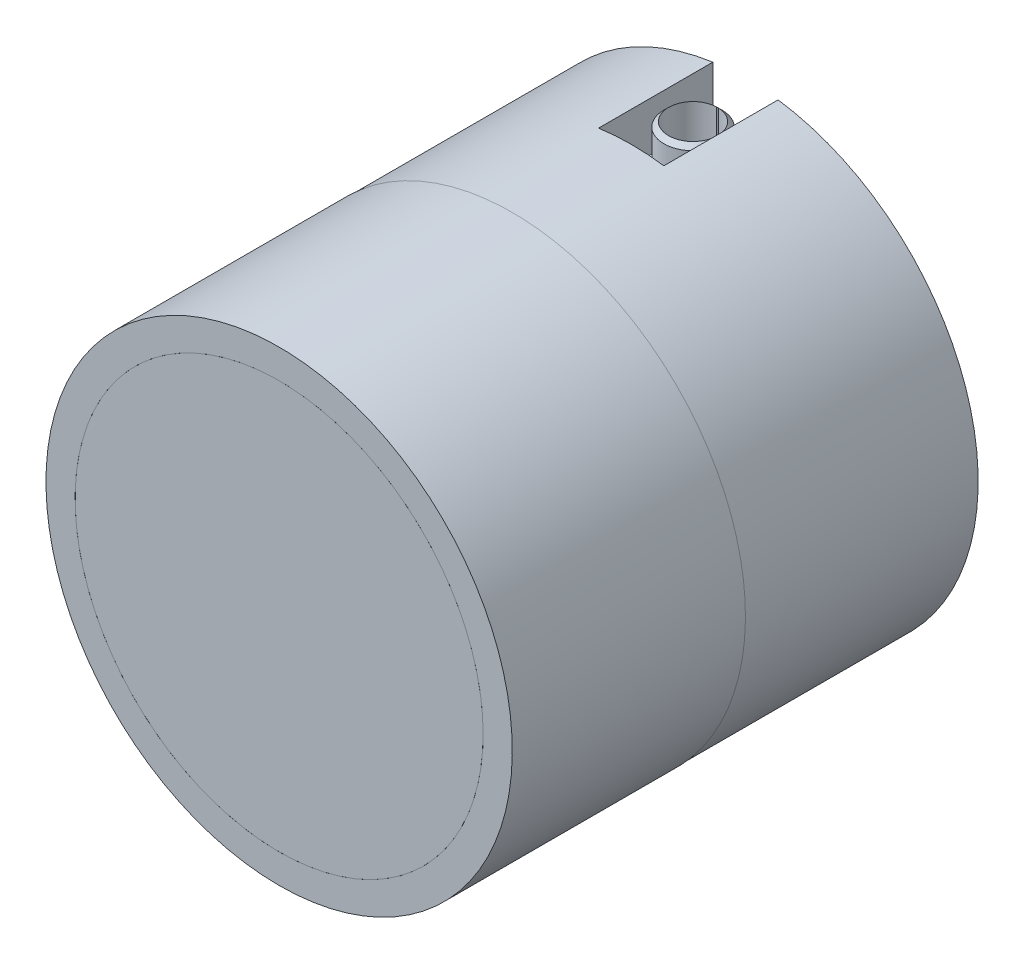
ISO-10303-21;
HEADER;
FILE_DESCRIPTION(('STEP AP214'),'2;1');
FILE_NAME('part.step','',(''),(''),'','','');
FILE_SCHEMA(('AUTOMOTIVE_DESIGN { 1 0 10303 214 1 1 1 1 }'));
ENDSEC;
DATA;
#1=APPLICATION_CONTEXT('core data for automotive mechanical design processes');
#2=APPLICATION_PROTOCOL_DEFINITION('international standard','automotive_design',2000,#1);
#3=PRODUCT_CONTEXT('',#1,'mechanical');
#4=PRODUCT('Part','Part','',(#3));
#5=PRODUCT_RELATED_PRODUCT_CATEGORY('part','',(#4));
#6=PRODUCT_DEFINITION_FORMATION('','',#4);
#7=PRODUCT_DEFINITION_CONTEXT('part definition',#1,'design');
#8=PRODUCT_DEFINITION('design','',#6,#7);
#9=PRODUCT_DEFINITION_SHAPE('','',#8);
#10=(LENGTH_UNIT() NAMED_UNIT(*) SI_UNIT(.MILLI.,.METRE.));
#11=(NAMED_UNIT(*) PLANE_ANGLE_UNIT() SI_UNIT($,.RADIAN.));
#12=(NAMED_UNIT(*) SI_UNIT($,.STERADIAN.) SOLID_ANGLE_UNIT());
#13=UNCERTAINTY_MEASURE_WITH_UNIT(LENGTH_MEASURE(1.E-05),#10,'distance_accuracy_value','');
#14=(GEOMETRIC_REPRESENTATION_CONTEXT(3) GLOBAL_UNCERTAINTY_ASSIGNED_CONTEXT((#13)) GLOBAL_UNIT_ASSIGNED_CONTEXT((#10,
#11,#12)) REPRESENTATION_CONTEXT('',''));
#15=CARTESIAN_POINT('',(0.,0.,0.));
#16=DIRECTION('',(0.,0.,1.));
#17=DIRECTION('',(1.,0.,0.));
#18=AXIS2_PLACEMENT_3D('',#15,#16,#17);
#19=CARTESIAN_POINT('',(0.,0.,0.));
#20=DIRECTION('',(0.,0.,-1.));
#21=DIRECTION('',(0.,1.,0.));
#22=AXIS2_PLACEMENT_3D('',#19,#20,#21);
#23=CYLINDRICAL_SURFACE('',#22,4.953);
#24=CARTESIAN_POINT('',(0.,0.,-5.55397045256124));
#25=DIRECTION('',(0.,0.,1.));
#26=DIRECTION('',(1.,0.,0.));
#27=AXIS2_PLACEMENT_3D('',#24,#25,#26);
#28=CIRCLE('',#27,4.953);
#29=CARTESIAN_POINT('',(4.953,0.,-5.55397045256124));
#30=VERTEX_POINT('',#29);
#31=EDGE_CURVE('P0_E150',#30,#30,#28,.T.);
#32=ORIENTED_EDGE('',*,*,#31,.T.);
#33=EDGE_LOOP('',(#32));
#34=FACE_BOUND('',#33,.T.);
#35=CARTESIAN_POINT('',(0.,0.,-6.604));
#36=DIRECTION('',(0.,0.,-1.));
#37=DIRECTION('',(0.,1.,0.));
#38=AXIS2_PLACEMENT_3D('',#35,#36,#37);
#39=CIRCLE('',#38,4.953);
#40=CARTESIAN_POINT('',(0.,4.95299999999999,-6.604));
#41=VERTEX_POINT('',#40);
#42=EDGE_CURVE('P0_E20',#41,#41,#39,.F.);
#43=ORIENTED_EDGE('',*,*,#42,.F.);
#44=EDGE_LOOP('',(#43));
#45=FACE_BOUND('',#44,.T.);
#46=ADVANCED_FACE('P0_F16',(#34,#45),#23,.F.);
#47=CARTESIAN_POINT('',(0.,12.6746,-25.4));
#48=DIRECTION('',(0.,0.,1.));
#49=DIRECTION('',(0.,-1.,0.));
#50=AXIS2_PLACEMENT_3D('',#47,#48,#49);
#51=PLANE('',#50);
#52=DIRECTION('',(0.,1.,0.));
#53=VECTOR('',#52,1.);
#54=CARTESIAN_POINT('',(1.778,12.6746,-25.4));
#55=LINE('',#54,#53);
#56=CARTESIAN_POINT('',(1.778,-12.5492709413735,-25.4));
#57=VERTEX_POINT('',#56);
#58=CARTESIAN_POINT('',(1.778,-9.874198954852,-25.4));
#59=VERTEX_POINT('',#58);
#60=EDGE_CURVE('P0_E98',#57,#59,#55,.T.);
#61=ORIENTED_EDGE('',*,*,#60,.T.);
#62=CARTESIAN_POINT('',(0.,0.,-25.4));
#63=DIRECTION('',(0.,0.,-1.));
#64=DIRECTION('',(0.,1.,0.));
#65=AXIS2_PLACEMENT_3D('',#62,#63,#64);
#66=CIRCLE('',#65,10.033);
#67=CARTESIAN_POINT('',(1.778,9.87419895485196,-25.4));
#68=VERTEX_POINT('',#67);
#69=EDGE_CURVE('P0_E83',#68,#59,#66,.T.);
#70=ORIENTED_EDGE('',*,*,#69,.F.);
#71=CARTESIAN_POINT('',(1.778,12.5492709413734,-25.4));
#72=VERTEX_POINT('',#71);
#73=EDGE_CURVE('P0_E96',#68,#72,#55,.T.);
#74=ORIENTED_EDGE('',*,*,#73,.T.);
#75=CARTESIAN_POINT('',(0.,0.,-25.4));
#76=DIRECTION('',(0.,0.,1.));
#77=DIRECTION('',(0.,-1.,0.));
#78=AXIS2_PLACEMENT_3D('',#75,#76,#77);
#79=CIRCLE('',#78,12.6746);
#80=EDGE_CURVE('P0_E166',#57,#72,#79,.T.);
#81=ORIENTED_EDGE('',*,*,#80,.F.);
#82=EDGE_LOOP('',(#61,#70,#74,#81));
#83=FACE_BOUND('',#82,.T.);
#84=ADVANCED_FACE('P0_F94',(#83),#51,.F.);
#85=CARTESIAN_POINT('',(0.,0.,0.));
#86=DIRECTION('',(0.,0.,1.));
#87=DIRECTION('',(0.,-1.,0.));
#88=AXIS2_PLACEMENT_3D('',#85,#86,#87);
#89=CYLINDRICAL_SURFACE('',#88,12.7);
#90=CARTESIAN_POINT('',(0.,0.,0.));
#91=DIRECTION('',(0.,0.,1.));
#92=DIRECTION('',(0.,-1.,0.));
#93=AXIS2_PLACEMENT_3D('',#90,#91,#92);
#94=CIRCLE('',#93,12.7);
#95=CARTESIAN_POINT('',(0.,-12.7,0.));
#96=VERTEX_POINT('',#95);
#97=EDGE_CURVE('P0_E156',#96,#96,#94,.T.);
#98=ORIENTED_EDGE('',*,*,#97,.F.);
#99=EDGE_LOOP('',(#98));
#100=FACE_BOUND('',#99,.T.);
#101=CARTESIAN_POINT('',(0.,0.,-12.7));
#102=DIRECTION('',(0.,0.,1.));
#103=DIRECTION('',(0.,-1.,0.));
#104=AXIS2_PLACEMENT_3D('',#101,#102,#103);
#105=CIRCLE('',#104,12.7);
#106=CARTESIAN_POINT('',(0.,-12.7,-12.7));
#107=VERTEX_POINT('',#106);
#108=EDGE_CURVE('P0_E170',#107,#107,#105,.T.);
#109=ORIENTED_EDGE('',*,*,#108,.T.);
#110=EDGE_LOOP('',(#109));
#111=FACE_BOUND('',#110,.T.);
#112=ADVANCED_FACE('P0_F18',(#100,#111),#89,.T.);
#113=CARTESIAN_POINT('',(0.,12.7,-12.7));
#114=DIRECTION('',(0.,0.,1.));
#115=DIRECTION('',(0.,-1.,0.));
#116=AXIS2_PLACEMENT_3D('',#113,#114,#115);
#117=PLANE('',#116);
#118=ORIENTED_EDGE('',*,*,#108,.F.);
#119=EDGE_LOOP('',(#118));
#120=FACE_BOUND('',#119,.T.);
#121=CARTESIAN_POINT('',(0.,0.,-12.7));
#122=DIRECTION('',(0.,0.,1.));
#123=DIRECTION('',(0.,-1.,0.));
#124=AXIS2_PLACEMENT_3D('',#121,#122,#123);
#125=CIRCLE('',#124,12.6746);
#126=CARTESIAN_POINT('',(0.,-12.6746,-12.7));
#127=VERTEX_POINT('',#126);
#128=EDGE_CURVE('P0_E168',#127,#127,#125,.T.);
#129=ORIENTED_EDGE('',*,*,#128,.T.);
#130=EDGE_LOOP('',(#129));
#131=FACE_BOUND('',#130,.T.);
#132=ADVANCED_FACE('P0_F175',(#120,#131),#117,.F.);
#133=CARTESIAN_POINT('',(0.,0.,0.));
#134=DIRECTION('',(0.,0.,1.));
#135=DIRECTION('',(0.,-1.,0.));
#136=AXIS2_PLACEMENT_3D('',#133,#134,#135);
#137=CYLINDRICAL_SURFACE('',#136,12.6746);
#138=ORIENTED_EDGE('',*,*,#128,.F.);
#139=EDGE_LOOP('',(#138));
#140=FACE_BOUND('',#139,.T.);
#141=CARTESIAN_POINT('',(0.,0.,-19.177));
#142=DIRECTION('',(0.,0.,1.));
#143=DIRECTION('',(1.,0.,0.));
#144=AXIS2_PLACEMENT_3D('',#141,#142,#143);
#145=CIRCLE('',#144,12.6746);
#146=CARTESIAN_POINT('',(-1.778,-12.5492709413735,-19.177));
#147=VERTEX_POINT('',#146);
#148=CARTESIAN_POINT('',(1.778,-12.5492709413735,-19.177));
#149=VERTEX_POINT('',#148);
#150=EDGE_CURVE('P0_E25',#147,#149,#145,.T.);
#151=ORIENTED_EDGE('',*,*,#150,.T.);
#152=DIRECTION('',(0.,0.,1.));
#153=VECTOR('',#152,1.);
#154=CARTESIAN_POINT('',(1.778,-12.5492709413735,0.));
#155=LINE('',#154,#153);
#156=EDGE_CURVE('P0_E120',#149,#57,#155,.F.);
#157=ORIENTED_EDGE('',*,*,#156,.T.);
#158=ORIENTED_EDGE('',*,*,#80,.T.);
#159=DIRECTION('',(0.,0.,1.));
#160=VECTOR('',#159,1.);
#161=CARTESIAN_POINT('',(1.778,12.5492709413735,0.));
#162=LINE('',#161,#160);
#163=CARTESIAN_POINT('',(1.778,12.5492709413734,-19.177));
#164=VERTEX_POINT('',#163);
#165=EDGE_CURVE('P0_E103',#72,#164,#162,.T.);
#166=ORIENTED_EDGE('',*,*,#165,.T.);
#167=CARTESIAN_POINT('',(-1.778,12.5492709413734,-19.177));
#168=VERTEX_POINT('',#167);
#169=EDGE_CURVE('P0_E107',#164,#168,#145,.T.);
#170=ORIENTED_EDGE('',*,*,#169,.T.);
#171=DIRECTION('',(0.,0.,1.));
#172=VECTOR('',#171,1.);
#173=CARTESIAN_POINT('',(-1.778,12.5492709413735,0.));
#174=LINE('',#173,#172);
#175=CARTESIAN_POINT('',(-1.778,12.5492709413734,-25.4));
#176=VERTEX_POINT('',#175);
#177=EDGE_CURVE('P0_E143',#168,#176,#174,.F.);
#178=ORIENTED_EDGE('',*,*,#177,.T.);
#179=CARTESIAN_POINT('',(-1.778,-12.5492709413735,-25.4));
#180=VERTEX_POINT('',#179);
#181=EDGE_CURVE('P0_E165',#176,#180,#79,.T.);
#182=ORIENTED_EDGE('',*,*,#181,.T.);
#183=DIRECTION('',(0.,0.,1.));
#184=VECTOR('',#183,1.);
#185=CARTESIAN_POINT('',(-1.778,-12.5492709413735,0.));
#186=LINE('',#185,#184);
#187=EDGE_CURVE('P0_E122',#180,#147,#186,.T.);
#188=ORIENTED_EDGE('',*,*,#187,.T.);
#189=EDGE_LOOP('',(#151,#157,#158,#166,#170,#178,#182,#188));
#190=FACE_BOUND('',#189,.T.);
#191=ADVANCED_FACE('P0_F119',(#140,#190),#137,.T.);
#192=DIRECTION('',(0.,-1.,0.));
#193=VECTOR('',#192,1.);
#194=CARTESIAN_POINT('',(-1.778,12.6746,-25.4));
#195=LINE('',#194,#193);
#196=CARTESIAN_POINT('',(-1.778,9.87419895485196,-25.4));
#197=VERTEX_POINT('',#196);
#198=EDGE_CURVE('P0_E105',#176,#197,#195,.T.);
#199=ORIENTED_EDGE('',*,*,#198,.T.);
#200=CARTESIAN_POINT('',(-1.778,-9.874198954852,-25.4));
#201=VERTEX_POINT('',#200);
#202=EDGE_CURVE('P0_E32',#201,#197,#66,.T.);
#203=ORIENTED_EDGE('',*,*,#202,.F.);
#204=EDGE_CURVE('P0_E38',#201,#180,#195,.T.);
#205=ORIENTED_EDGE('',*,*,#204,.T.);
#206=ORIENTED_EDGE('',*,*,#181,.F.);
#207=EDGE_LOOP('',(#199,#203,#205,#206));
#208=FACE_BOUND('',#207,.T.);
#209=ADVANCED_FACE('P0_F181',(#208),#51,.F.);
#210=CARTESIAN_POINT('',(0.,9.75131810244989,-5.08));
#211=DIRECTION('',(0.,0.,-1.));
#212=DIRECTION('',(0.,1.,0.));
#213=AXIS2_PLACEMENT_3D('',#210,#211,#212);
#214=PLANE('',#213);
#215=CARTESIAN_POINT('',(0.,0.,-5.08));
#216=DIRECTION('',(0.,0.,1.));
#217=DIRECTION('',(1.,0.,0.));
#218=AXIS2_PLACEMENT_3D('',#215,#216,#217);
#219=CIRCLE('',#218,5.334);
#220=CARTESIAN_POINT('',(5.334,0.,-5.08));
#221=VERTEX_POINT('',#220);
#222=EDGE_CURVE('P0_E153',#221,#221,#219,.T.);
#223=ORIENTED_EDGE('',*,*,#222,.F.);
#224=EDGE_LOOP('',(#223));
#225=FACE_BOUND('',#224,.T.);
#226=CARTESIAN_POINT('',(0.,0.,-5.07999999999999));
#227=DIRECTION('',(0.,0.,1.));
#228=DIRECTION('',(0.,-1.,0.));
#229=AXIS2_PLACEMENT_3D('',#226,#227,#228);
#230=CIRCLE('',#229,9.7513181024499);
#231=CARTESIAN_POINT('',(0.,-9.7513181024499,-5.07999999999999));
#232=VERTEX_POINT('',#231);
#233=EDGE_CURVE('P0_E162',#232,#232,#230,.T.);
#234=ORIENTED_EDGE('',*,*,#233,.T.);
#235=EDGE_LOOP('',(#234));
#236=FACE_BOUND('',#235,.T.);
#237=ADVANCED_FACE('P0_F187',(#225,#236),#214,.F.);
#238=CARTESIAN_POINT('',(0.,0.,0.));
#239=DIRECTION('',(0.,0.,1.));
#240=DIRECTION('',(0.,-1.,0.));
#241=AXIS2_PLACEMENT_3D('',#238,#239,#240);
#242=CONICAL_SURFACE('',#241,11.1125,0.261799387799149);
#243=ORIENTED_EDGE('',*,*,#233,.F.);
#244=EDGE_LOOP('',(#243));
#245=FACE_BOUND('',#244,.T.);
#246=CARTESIAN_POINT('',(0.,0.,0.));
#247=DIRECTION('',(0.,0.,1.));
#248=DIRECTION('',(0.,-1.,0.));
#249=AXIS2_PLACEMENT_3D('',#246,#247,#248);
#250=CIRCLE('',#249,11.1125);
#251=CARTESIAN_POINT('',(0.,-11.1125,0.));
#252=VERTEX_POINT('',#251);
#253=EDGE_CURVE('P0_E159',#252,#252,#250,.T.);
#254=ORIENTED_EDGE('',*,*,#253,.T.);
#255=EDGE_LOOP('',(#254));
#256=FACE_BOUND('',#255,.T.);
#257=ADVANCED_FACE('P0_F203',(#245,#256),#242,.F.);
#258=CARTESIAN_POINT('',(0.,11.1125,0.));
#259=DIRECTION('',(0.,0.,-1.));
#260=DIRECTION('',(0.,1.,0.));
#261=AXIS2_PLACEMENT_3D('',#258,#259,#260);
#262=PLANE('',#261);
#263=ORIENTED_EDGE('',*,*,#253,.F.);
#264=EDGE_LOOP('',(#263));
#265=FACE_BOUND('',#264,.T.);
#266=ORIENTED_EDGE('',*,*,#97,.T.);
#267=EDGE_LOOP('',(#266));
#268=FACE_BOUND('',#267,.T.);
#269=ADVANCED_FACE('P0_F200',(#265,#268),#262,.F.);
#270=CARTESIAN_POINT('',(0.,0.,-5.334));
#271=DIRECTION('',(0.,0.,1.));
#272=DIRECTION('',(1.,0.,0.));
#273=AXIS2_PLACEMENT_3D('',#270,#271,#272);
#274=CYLINDRICAL_SURFACE('',#273,5.334);
#275=CARTESIAN_POINT('',(0.,0.,-5.334));
#276=DIRECTION('',(0.,0.,1.));
#277=DIRECTION('',(1.,0.,0.));
#278=AXIS2_PLACEMENT_3D('',#275,#276,#277);
#279=CIRCLE('',#278,5.334);
#280=CARTESIAN_POINT('',(5.334,0.,-5.334));
#281=VERTEX_POINT('',#280);
#282=EDGE_CURVE('P0_E147',#281,#281,#279,.T.);
#283=ORIENTED_EDGE('',*,*,#282,.F.);
#284=EDGE_LOOP('',(#283));
#285=FACE_BOUND('',#284,.T.);
#286=ORIENTED_EDGE('',*,*,#222,.T.);
#287=EDGE_LOOP('',(#286));
#288=FACE_BOUND('',#287,.T.);
#289=ADVANCED_FACE('P0_F198',(#285,#288),#274,.F.);
#290=CARTESIAN_POINT('',(0.,0.,-5.334));
#291=DIRECTION('',(0.,0.,1.));
#292=DIRECTION('',(1.,0.,0.));
#293=AXIS2_PLACEMENT_3D('',#290,#291,#292);
#294=CONICAL_SURFACE('',#293,5.334,1.0471975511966);
#295=ORIENTED_EDGE('',*,*,#282,.T.);
#296=EDGE_LOOP('',(#295));
#297=FACE_BOUND('',#296,.T.);
#298=ORIENTED_EDGE('',*,*,#31,.F.);
#299=EDGE_LOOP('',(#298));
#300=FACE_BOUND('',#299,.T.);
#301=ADVANCED_FACE('P0_F277',(#297,#300),#294,.F.);
#302=CARTESIAN_POINT('',(-1.778,-12.7,-20.828));
#303=DIRECTION('',(-1.,0.,0.));
#304=DIRECTION('',(0.,0.,1.));
#305=AXIS2_PLACEMENT_3D('',#302,#303,#304);
#306=PLANE('',#305);
#307=ORIENTED_EDGE('',*,*,#204,.F.);
#308=DIRECTION('',(0.,0.,-1.));
#309=VECTOR('',#308,1.);
#310=CARTESIAN_POINT('',(-1.778,-9.87419895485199,-6.60399999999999));
#311=LINE('',#310,#309);
#312=CARTESIAN_POINT('',(-1.778,-9.87419895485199,-19.177));
#313=VERTEX_POINT('',#312);
#314=EDGE_CURVE('P0_E135',#201,#313,#311,.F.);
#315=ORIENTED_EDGE('',*,*,#314,.T.);
#316=DIRECTION('',(0.,1.,0.));
#317=VECTOR('',#316,1.);
#318=CARTESIAN_POINT('',(-1.778,-12.7,-19.177));
#319=LINE('',#318,#317);
#320=EDGE_CURVE('P0_E129',#147,#313,#319,.T.);
#321=ORIENTED_EDGE('',*,*,#320,.F.);
#322=ORIENTED_EDGE('',*,*,#187,.F.);
#323=EDGE_LOOP('',(#307,#315,#321,#322));
#324=FACE_BOUND('',#323,.T.);
#325=ADVANCED_FACE('P0_F134',(#324),#306,.F.);
#326=CARTESIAN_POINT('',(1.778,-12.7,-26.543));
#327=DIRECTION('',(1.,0.,0.));
#328=DIRECTION('',(0.,0.,-1.));
#329=AXIS2_PLACEMENT_3D('',#326,#327,#328);
#330=PLANE('',#329);
#331=DIRECTION('',(0.,1.,0.));
#332=VECTOR('',#331,1.);
#333=CARTESIAN_POINT('',(1.778,-12.7,-19.177));
#334=LINE('',#333,#332);
#335=CARTESIAN_POINT('',(1.778,-9.87419895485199,-19.177));
#336=VERTEX_POINT('',#335);
#337=EDGE_CURVE('P0_E131',#149,#336,#334,.T.);
#338=ORIENTED_EDGE('',*,*,#337,.T.);
#339=DIRECTION('',(0.,0.,-1.));
#340=VECTOR('',#339,1.);
#341=CARTESIAN_POINT('',(1.778,-9.87419895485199,-6.60399999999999));
#342=LINE('',#341,#340);
#343=EDGE_CURVE('P0_E410',#336,#59,#342,.T.);
#344=ORIENTED_EDGE('',*,*,#343,.T.);
#345=ORIENTED_EDGE('',*,*,#60,.F.);
#346=ORIENTED_EDGE('',*,*,#156,.F.);
#347=EDGE_LOOP('',(#338,#344,#345,#346));
#348=FACE_BOUND('',#347,.T.);
#349=ADVANCED_FACE('P0_F296',(#348),#330,.F.);
#350=CARTESIAN_POINT('',(0.127000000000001,-12.7,-19.177));
#351=DIRECTION('',(0.,0.,1.));
#352=DIRECTION('',(1.,0.,0.));
#353=AXIS2_PLACEMENT_3D('',#350,#351,#352);
#354=PLANE('',#353);
#355=ORIENTED_EDGE('',*,*,#320,.T.);
#356=CARTESIAN_POINT('',(0.,0.,-19.177));
#357=DIRECTION('',(0.,0.,1.));
#358=DIRECTION('',(1.,0.,0.));
#359=AXIS2_PLACEMENT_3D('',#356,#357,#358);
#360=CIRCLE('',#359,10.033);
#361=EDGE_CURVE('P0_E90',#313,#336,#360,.T.);
#362=ORIENTED_EDGE('',*,*,#361,.T.);
#363=ORIENTED_EDGE('',*,*,#337,.F.);
#364=ORIENTED_EDGE('',*,*,#150,.F.);
#365=EDGE_LOOP('',(#355,#362,#363,#364));
#366=FACE_BOUND('',#365,.T.);
#367=ADVANCED_FACE('P0_F127',(#366),#354,.F.);
#368=CARTESIAN_POINT('',(1.778,9.87419895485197,-19.177));
#369=VERTEX_POINT('',#368);
#370=EDGE_CURVE('P0_E136',#369,#164,#334,.T.);
#371=ORIENTED_EDGE('',*,*,#370,.F.);
#372=CARTESIAN_POINT('',(0.,0.,-19.177));
#373=DIRECTION('',(0.,0.,1.));
#374=DIRECTION('',(1.,0.,0.));
#375=AXIS2_PLACEMENT_3D('',#372,#373,#374);
#376=CIRCLE('',#375,10.033);
#377=CARTESIAN_POINT('',(-1.778,9.87419895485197,-19.177));
#378=VERTEX_POINT('',#377);
#379=EDGE_CURVE('P0_E86',#369,#378,#376,.T.);
#380=ORIENTED_EDGE('',*,*,#379,.T.);
#381=EDGE_CURVE('P0_E137',#378,#168,#319,.T.);
#382=ORIENTED_EDGE('',*,*,#381,.T.);
#383=ORIENTED_EDGE('',*,*,#169,.F.);
#384=EDGE_LOOP('',(#371,#380,#382,#383));
#385=FACE_BOUND('',#384,.T.);
#386=ADVANCED_FACE('P0_F317',(#385),#354,.F.);
#387=ORIENTED_EDGE('',*,*,#73,.F.);
#388=DIRECTION('',(0.,0.,-1.));
#389=VECTOR('',#388,1.);
#390=CARTESIAN_POINT('',(1.778,9.87419895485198,-6.604));
#391=LINE('',#390,#389);
#392=EDGE_CURVE('P0_E80',#68,#369,#391,.F.);
#393=ORIENTED_EDGE('',*,*,#392,.T.);
#394=ORIENTED_EDGE('',*,*,#370,.T.);
#395=ORIENTED_EDGE('',*,*,#165,.F.);
#396=EDGE_LOOP('',(#387,#393,#394,#395));
#397=FACE_BOUND('',#396,.T.);
#398=ADVANCED_FACE('P0_F101',(#397),#330,.F.);
#399=ORIENTED_EDGE('',*,*,#381,.F.);
#400=DIRECTION('',(0.,0.,-1.));
#401=VECTOR('',#400,1.);
#402=CARTESIAN_POINT('',(-1.778,9.87419895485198,-6.604));
#403=LINE('',#402,#401);
#404=EDGE_CURVE('P0_E10',#378,#197,#403,.T.);
#405=ORIENTED_EDGE('',*,*,#404,.T.);
#406=ORIENTED_EDGE('',*,*,#198,.F.);
#407=ORIENTED_EDGE('',*,*,#177,.F.);
#408=EDGE_LOOP('',(#399,#405,#406,#407));
#409=FACE_BOUND('',#408,.T.);
#410=ADVANCED_FACE('P0_F298',(#409),#306,.F.);
#411=CARTESIAN_POINT('',(0.,0.,-6.604));
#412=DIRECTION('',(0.,0.,-1.));
#413=DIRECTION('',(0.,1.,0.));
#414=AXIS2_PLACEMENT_3D('',#411,#412,#413);
#415=PLANE('',#414);
#416=CARTESIAN_POINT('',(0.,0.,-6.604));
#417=DIRECTION('',(0.,0.,-1.));
#418=DIRECTION('',(0.,1.,0.));
#419=AXIS2_PLACEMENT_3D('',#416,#417,#418);
#420=CIRCLE('',#419,10.033);
#421=CARTESIAN_POINT('',(0.,10.033,-6.604));
#422=VERTEX_POINT('',#421);
#423=EDGE_CURVE('P0_E99',#422,#422,#420,.T.);
#424=ORIENTED_EDGE('',*,*,#423,.T.);
#425=EDGE_LOOP('',(#424));
#426=FACE_BOUND('',#425,.T.);
#427=ORIENTED_EDGE('',*,*,#42,.T.);
#428=EDGE_LOOP('',(#427));
#429=FACE_BOUND('',#428,.T.);
#430=ADVANCED_FACE('P0_F344',(#426,#429),#415,.T.);
#431=CARTESIAN_POINT('',(0.,0.,-6.604));
#432=DIRECTION('',(0.,0.,-1.));
#433=DIRECTION('',(0.,1.,0.));
#434=AXIS2_PLACEMENT_3D('',#431,#432,#433);
#435=CYLINDRICAL_SURFACE('',#434,10.033);
#436=ORIENTED_EDGE('',*,*,#423,.F.);
#437=EDGE_LOOP('',(#436));
#438=FACE_BOUND('',#437,.T.);
#439=ORIENTED_EDGE('',*,*,#202,.T.);
#440=ORIENTED_EDGE('',*,*,#404,.F.);
#441=ORIENTED_EDGE('',*,*,#379,.F.);
#442=ORIENTED_EDGE('',*,*,#392,.F.);
#443=ORIENTED_EDGE('',*,*,#69,.T.);
#444=ORIENTED_EDGE('',*,*,#343,.F.);
#445=ORIENTED_EDGE('',*,*,#361,.F.);
#446=ORIENTED_EDGE('',*,*,#314,.F.);
#447=EDGE_LOOP('',(#439,#440,#441,#442,#443,#444,#445,#446));
#448=FACE_BOUND('',#447,.T.);
#449=ADVANCED_FACE('P0_F82',(#438,#448),#435,.F.);
#450=CLOSED_SHELL('',(#46,#84,#112,#132,#191,#209,#237,#257,#269,#289,#301,#325,#349,#367,#386,
#398,#410,#430,#449));
#451=MANIFOLD_SOLID_BREP('P0_B1',#450);
#452=CARTESIAN_POINT('',(0.,12.065,-22.5425));
#453=DIRECTION('',(0.,-1.,0.));
#454=DIRECTION('',(-1.,0.,0.));
#455=AXIS2_PLACEMENT_3D('',#452,#453,#454);
#456=CYLINDRICAL_SURFACE('',#455,1.3335);
#457=CARTESIAN_POINT('',(0.,-12.065,-22.5425));
#458=DIRECTION('',(0.,-1.,0.));
#459=DIRECTION('',(1.,0.,0.));
#460=AXIS2_PLACEMENT_3D('',#457,#458,#459);
#461=CIRCLE('',#460,1.3335);
#462=CARTESIAN_POINT('',(0.0635000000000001,-12.065,-23.8744872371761));
#463=VERTEX_POINT('',#462);
#464=CARTESIAN_POINT('',(-0.0635000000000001,-12.065,-23.8744872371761));
#465=VERTEX_POINT('',#464);
#466=EDGE_CURVE('P1_E74',#463,#465,#461,.T.);
#467=ORIENTED_EDGE('',*,*,#466,.T.);
#468=DIRECTION('',(0.,-1.,0.));
#469=VECTOR('',#468,1.);
#470=CARTESIAN_POINT('',(-0.0635000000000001,12.065,-23.8744872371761));
#471=LINE('',#470,#469);
#472=CARTESIAN_POINT('',(-0.0635000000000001,12.065,-23.8744872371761));
#473=VERTEX_POINT('',#472);
#474=EDGE_CURVE('P1_E63',#473,#465,#471,.T.);
#475=ORIENTED_EDGE('',*,*,#474,.F.);
#476=CARTESIAN_POINT('',(0.,12.065,-22.5425));
#477=DIRECTION('',(0.,-1.,0.));
#478=DIRECTION('',(1.,0.,0.));
#479=AXIS2_PLACEMENT_3D('',#476,#477,#478);
#480=CIRCLE('',#479,1.3335);
#481=CARTESIAN_POINT('',(0.0635000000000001,12.065,-23.8744872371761));
#482=VERTEX_POINT('',#481);
#483=EDGE_CURVE('P1_E72',#482,#473,#480,.T.);
#484=ORIENTED_EDGE('',*,*,#483,.F.);
#485=DIRECTION('',(0.,-1.,0.));
#486=VECTOR('',#485,1.);
#487=CARTESIAN_POINT('',(0.0635000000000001,12.065,-23.8744872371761));
#488=LINE('',#487,#486);
#489=EDGE_CURVE('P1_E78',#482,#463,#488,.T.);
#490=ORIENTED_EDGE('',*,*,#489,.T.);
#491=EDGE_LOOP('',(#467,#475,#484,#490));
#492=FACE_BOUND('',#491,.T.);
#493=ADVANCED_FACE('P1_F17',(#492),#456,.F.);
#494=CARTESIAN_POINT('',(-0.0635000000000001,12.065,-24.1287294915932));
#495=DIRECTION('',(-1.,0.,0.));
#496=DIRECTION('',(0.,0.,1.));
#497=AXIS2_PLACEMENT_3D('',#494,#495,#496);
#498=PLANE('',#497);
#499=ORIENTED_EDGE('',*,*,#474,.T.);
#500=CARTESIAN_POINT('',(-0.0635000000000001,-12.065,-23.8744872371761));
#501=CARTESIAN_POINT('',(-0.0635000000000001,-12.0226701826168,-23.9168644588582));
#502=CARTESIAN_POINT('',(-0.0635000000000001,-11.9803386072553,-23.9592399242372));
#503=CARTESIAN_POINT('',(-0.0635000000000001,-11.8956719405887,-24.0439873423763));
#504=CARTESIAN_POINT('',(-0.0635000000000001,-11.8533368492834,-24.0863592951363));
#505=CARTESIAN_POINT('',(-0.0635000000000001,-11.811,-24.1287294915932));
#506=B_SPLINE_CURVE_WITH_KNOTS('',3,(#500,#501,#502,#503,#504,#505),.UNSPECIFIED.,.F.,.F.,(4,2,
4),(0.,0.179690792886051,0.359381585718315),.UNSPECIFIED.);
#507=CARTESIAN_POINT('',(-0.0635,-11.811,-24.1287294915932));
#508=VERTEX_POINT('',#507);
#509=EDGE_CURVE('P1_E11',#465,#508,#506,.T.);
#510=ORIENTED_EDGE('',*,*,#509,.T.);
#511=DIRECTION('',(0.,-1.,0.));
#512=VECTOR('',#511,1.);
#513=CARTESIAN_POINT('',(-0.0635,12.065,-24.1287294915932));
#514=LINE('',#513,#512);
#515=CARTESIAN_POINT('',(-0.0635,11.811,-24.1287294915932));
#516=VERTEX_POINT('',#515);
#517=EDGE_CURVE('P1_E65',#516,#508,#514,.T.);
#518=ORIENTED_EDGE('',*,*,#517,.F.);
#519=CARTESIAN_POINT('',(-0.0635,11.811,-24.1287294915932));
#520=CARTESIAN_POINT('',(-0.0635,11.8533368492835,-24.0863592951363));
#521=CARTESIAN_POINT('',(-0.0635000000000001,11.8956719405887,-24.0439873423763));
#522=CARTESIAN_POINT('',(-0.0635000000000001,11.9803386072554,-23.9592399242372));
#523=CARTESIAN_POINT('',(-0.0635000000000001,12.0226701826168,-23.9168644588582));
#524=CARTESIAN_POINT('',(-0.0635000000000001,12.065,-23.8744872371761));
#525=B_SPLINE_CURVE_WITH_KNOTS('',3,(#519,#520,#521,#522,#523,#524),.UNSPECIFIED.,.F.,.F.,(4,2,
4),(0.,0.179690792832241,0.359381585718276),.UNSPECIFIED.);
#526=EDGE_CURVE('P1_E31',#516,#473,#525,.T.);
#527=ORIENTED_EDGE('',*,*,#526,.T.);
#528=EDGE_LOOP('',(#499,#510,#518,#527));
#529=FACE_BOUND('',#528,.T.);
#530=ADVANCED_FACE('P1_F62',(#529),#498,.F.);
#531=CARTESIAN_POINT('',(0.,12.065,-22.5425));
#532=DIRECTION('',(0.,-1.,0.));
#533=DIRECTION('',(-1.,0.,0.));
#534=AXIS2_PLACEMENT_3D('',#531,#532,#533);
#535=CYLINDRICAL_SURFACE('',#534,1.5875);
#536=ORIENTED_EDGE('',*,*,#517,.T.);
#537=CARTESIAN_POINT('',(0.,-11.811,-22.5425));
#538=DIRECTION('',(0.,1.,0.));
#539=DIRECTION('',(1.,0.,0.));
#540=AXIS2_PLACEMENT_3D('',#537,#538,#539);
#541=CIRCLE('',#540,1.5875);
#542=CARTESIAN_POINT('',(0.0635000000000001,-11.811,-24.1287294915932));
#543=VERTEX_POINT('',#542);
#544=EDGE_CURVE('P1_E88',#508,#543,#541,.T.);
#545=ORIENTED_EDGE('',*,*,#544,.T.);
#546=DIRECTION('',(0.,-1.,0.));
#547=VECTOR('',#546,1.);
#548=CARTESIAN_POINT('',(0.0635000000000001,12.065,-24.1287294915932));
#549=LINE('',#548,#547);
#550=CARTESIAN_POINT('',(0.0635000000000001,11.811,-24.1287294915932));
#551=VERTEX_POINT('',#550);
#552=EDGE_CURVE('P1_E80',#551,#543,#549,.T.);
#553=ORIENTED_EDGE('',*,*,#552,.F.);
#554=CARTESIAN_POINT('',(0.,11.811,-22.5425));
#555=DIRECTION('',(0.,1.,0.));
#556=DIRECTION('',(1.,0.,0.));
#557=AXIS2_PLACEMENT_3D('',#554,#555,#556);
#558=CIRCLE('',#557,1.5875);
#559=EDGE_CURVE('P1_E43',#551,#516,#558,.F.);
#560=ORIENTED_EDGE('',*,*,#559,.T.);
#561=EDGE_LOOP('',(#536,#545,#553,#560));
#562=FACE_BOUND('',#561,.T.);
#563=ADVANCED_FACE('P1_F106',(#562),#535,.T.);
#564=CARTESIAN_POINT('',(0.0635000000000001,12.065,-24.1287294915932));
#565=DIRECTION('',(1.,0.,0.));
#566=DIRECTION('',(0.,0.,-1.));
#567=AXIS2_PLACEMENT_3D('',#564,#565,#566);
#568=PLANE('',#567);
#569=ORIENTED_EDGE('',*,*,#552,.T.);
#570=CARTESIAN_POINT('',(0.0635000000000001,-11.811,-24.1287294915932));
#571=CARTESIAN_POINT('',(0.0635000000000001,-11.8533368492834,-24.0863592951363));
#572=CARTESIAN_POINT('',(0.0635000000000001,-11.8956719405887,-24.0439873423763));
#573=CARTESIAN_POINT('',(0.0635000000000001,-11.9803386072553,-23.9592399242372));
#574=CARTESIAN_POINT('',(0.0635000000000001,-12.0226701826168,-23.9168644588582));
#575=CARTESIAN_POINT('',(0.0635000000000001,-12.065,-23.8744872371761));
#576=B_SPLINE_CURVE_WITH_KNOTS('',3,(#570,#571,#572,#573,#574,#575),.UNSPECIFIED.,.F.,.F.,(4,2,
4),(0.,0.179690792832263,0.359381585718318),.UNSPECIFIED.);
#577=EDGE_CURVE('P1_E68',#543,#463,#576,.T.);
#578=ORIENTED_EDGE('',*,*,#577,.T.);
#579=ORIENTED_EDGE('',*,*,#489,.F.);
#580=CARTESIAN_POINT('',(0.0635000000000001,12.065,-23.8744872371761));
#581=CARTESIAN_POINT('',(0.0635000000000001,12.0226701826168,-23.9168644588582));
#582=CARTESIAN_POINT('',(0.0635000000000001,11.9803386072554,-23.9592399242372));
#583=CARTESIAN_POINT('',(0.0635000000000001,11.8956719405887,-24.0439873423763));
#584=CARTESIAN_POINT('',(0.0635000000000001,11.8533368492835,-24.0863592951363));
#585=CARTESIAN_POINT('',(0.0635000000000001,11.811,-24.1287294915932));
#586=B_SPLINE_CURVE_WITH_KNOTS('',3,(#580,#581,#582,#583,#584,#585),.UNSPECIFIED.,.F.,.F.,(4,2,
4),(0.,0.179690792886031,0.359381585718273),.UNSPECIFIED.);
#587=EDGE_CURVE('P1_E76',#482,#551,#586,.T.);
#588=ORIENTED_EDGE('',*,*,#587,.T.);
#589=EDGE_LOOP('',(#569,#578,#579,#588));
#590=FACE_BOUND('',#589,.T.);
#591=ADVANCED_FACE('P1_F101',(#590),#568,.F.);
#592=CARTESIAN_POINT('',(0.,-11.811,-22.5425));
#593=DIRECTION('',(0.,1.,0.));
#594=DIRECTION('',(1.,0.,0.));
#595=AXIS2_PLACEMENT_3D('',#592,#593,#594);
#596=CONICAL_SURFACE('',#595,1.5875,0.785398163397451);
#597=ORIENTED_EDGE('',*,*,#509,.F.);
#598=ORIENTED_EDGE('',*,*,#466,.F.);
#599=ORIENTED_EDGE('',*,*,#577,.F.);
#600=ORIENTED_EDGE('',*,*,#544,.F.);
#601=EDGE_LOOP('',(#597,#598,#599,#600));
#602=FACE_BOUND('',#601,.T.);
#603=ADVANCED_FACE('P1_F105',(#602),#596,.T.);
#604=CARTESIAN_POINT('',(0.,12.065,-22.5425));
#605=DIRECTION('',(0.,-1.,0.));
#606=DIRECTION('',(-1.,0.,0.));
#607=AXIS2_PLACEMENT_3D('',#604,#605,#606);
#608=CONICAL_SURFACE('',#607,1.33350000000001,0.785398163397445);
#609=ORIENTED_EDGE('',*,*,#526,.F.);
#610=ORIENTED_EDGE('',*,*,#559,.F.);
#611=ORIENTED_EDGE('',*,*,#587,.F.);
#612=ORIENTED_EDGE('',*,*,#483,.T.);
#613=EDGE_LOOP('',(#609,#610,#611,#612));
#614=FACE_BOUND('',#613,.T.);
#615=ADVANCED_FACE('P1_F19',(#614),#608,.T.);
#616=CLOSED_SHELL('',(#493,#530,#563,#591,#603,#615));
#617=MANIFOLD_SOLID_BREP('P1_B1',#616);
#618=CARTESIAN_POINT('',(8.763,0.,-19.2532));
#619=DIRECTION('',(0.,1.,0.));
#620=DIRECTION('',(0.,0.,1.));
#621=AXIS2_PLACEMENT_3D('',#618,#619,#620);
#622=PLANE('',#621);
#623=CARTESIAN_POINT('',(8.763,0.,-19.2532));
#624=DIRECTION('',(0.,1.,0.));
#625=DIRECTION('',(0.,0.,1.));
#626=AXIS2_PLACEMENT_3D('',#623,#624,#625);
#627=CIRCLE('',#626,0.762000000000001);
#628=CARTESIAN_POINT('',(8.763,0.,-18.4912));
#629=VERTEX_POINT('',#628);
#630=EDGE_CURVE('P2_E24',#629,#629,#627,.T.);
#631=ORIENTED_EDGE('',*,*,#630,.T.);
#632=EDGE_LOOP('',(#631));
#633=FACE_BOUND('',#632,.T.);
#634=ADVANCED_FACE('P2_F17',(#633),#622,.T.);
#635=CARTESIAN_POINT('',(8.763,-4.62409650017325E-13,-7.366));
#636=DIRECTION('',(0.,1.,0.));
#637=DIRECTION('',(0.,0.,1.));
#638=AXIS2_PLACEMENT_3D('',#635,#636,#637);
#639=PLANE('',#638);
#640=CARTESIAN_POINT('',(8.763,-4.62409650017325E-13,-7.366));
#641=DIRECTION('',(0.,1.,0.));
#642=DIRECTION('',(0.,0.,1.));
#643=AXIS2_PLACEMENT_3D('',#640,#641,#642);
#644=CIRCLE('',#643,0.762000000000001);
#645=CARTESIAN_POINT('',(8.763,-4.62409650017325E-13,-6.604));
#646=VERTEX_POINT('',#645);
#647=EDGE_CURVE('P2_E11',#646,#646,#644,.T.);
#648=ORIENTED_EDGE('',*,*,#647,.F.);
#649=EDGE_LOOP('',(#648));
#650=FACE_BOUND('',#649,.T.);
#651=ADVANCED_FACE('P2_F33',(#650),#639,.F.);
#652=CARTESIAN_POINT('',(8.763,0.,-18.4912));
#653=CARTESIAN_POINT('',(8.763,-5.05932040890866,-18.24355));
#654=CARTESIAN_POINT('',(4.3815,-7.58898061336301,-17.9959));
#655=CARTESIAN_POINT('',(0.,-10.1186408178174,-17.74825));
#656=CARTESIAN_POINT('',(-4.3815,-7.58898061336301,-17.5006));
#657=CARTESIAN_POINT('',(-8.76299999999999,-5.05932040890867,-17.25295));
#658=CARTESIAN_POINT('',(-8.763,0.,-17.0053));
#659=CARTESIAN_POINT('',(-8.763,5.05932040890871,-16.75765));
#660=CARTESIAN_POINT('',(-4.3815,7.58898061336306,-16.51));
#661=CARTESIAN_POINT('',(0.,10.1186408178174,-16.26235));
#662=CARTESIAN_POINT('',(4.38149999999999,7.58898061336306,-16.0147));
#663=CARTESIAN_POINT('',(8.76299999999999,5.05932040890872,-15.76705));
#664=CARTESIAN_POINT('',(8.763,0.,-15.5194));
#665=CARTESIAN_POINT('',(8.763,-5.05932040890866,-15.27175));
#666=CARTESIAN_POINT('',(4.3815,-7.58898061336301,-15.0241));
#667=CARTESIAN_POINT('',(0.,-10.1186408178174,-14.77645));
#668=CARTESIAN_POINT('',(-4.3815,-7.58898061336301,-14.5288));
#669=CARTESIAN_POINT('',(-8.76299999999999,-5.05932040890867,-14.28115));
#670=CARTESIAN_POINT('',(-8.763,0.,-14.0335));
#671=CARTESIAN_POINT('',(-8.763,5.05932040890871,-13.78585));
#672=CARTESIAN_POINT('',(-4.3815,7.58898061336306,-13.5382));
#673=CARTESIAN_POINT('',(0.,10.1186408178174,-13.29055));
#674=CARTESIAN_POINT('',(4.38149999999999,7.58898061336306,-13.0429));
#675=CARTESIAN_POINT('',(8.76299999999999,5.05932040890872,-12.79525));
#676=CARTESIAN_POINT('',(8.763,0.,-12.5476));
#677=CARTESIAN_POINT('',(8.763,-5.05932040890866,-12.29995));
#678=CARTESIAN_POINT('',(4.3815,-7.58898061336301,-12.0523));
#679=CARTESIAN_POINT('',(0.,-10.1186408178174,-11.80465));
#680=CARTESIAN_POINT('',(-4.3815,-7.58898061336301,-11.557));
#681=CARTESIAN_POINT('',(-8.76299999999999,-5.05932040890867,-11.30935));
#682=CARTESIAN_POINT('',(-8.763,0.,-11.0617));
#683=CARTESIAN_POINT('',(-8.763,5.05932040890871,-10.81405));
#684=CARTESIAN_POINT('',(-4.3815,7.58898061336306,-10.5664));
#685=CARTESIAN_POINT('',(0.,10.1186408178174,-10.31875));
#686=CARTESIAN_POINT('',(4.38149999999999,7.58898061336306,-10.0711));
#687=CARTESIAN_POINT('',(8.76299999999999,5.05932040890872,-9.82345000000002));
#688=CARTESIAN_POINT('',(8.763,0.,-9.57580000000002));
#689=CARTESIAN_POINT('',(8.763,-5.05932040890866,-9.32815000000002));
#690=CARTESIAN_POINT('',(4.3815,-7.58898061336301,-9.08050000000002));
#691=CARTESIAN_POINT('',(0.,-10.1186408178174,-8.83285000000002));
#692=CARTESIAN_POINT('',(-4.3815,-7.58898061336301,-8.58520000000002));
#693=CARTESIAN_POINT('',(-8.76299999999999,-5.05932040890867,-8.33755000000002));
#694=CARTESIAN_POINT('',(-8.763,0.,-8.08990000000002));
#695=CARTESIAN_POINT('',(-8.763,5.05932040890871,-7.84225000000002));
#696=CARTESIAN_POINT('',(-4.3815,7.58898061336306,-7.59460000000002));
#697=CARTESIAN_POINT('',(0.,10.1186408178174,-7.34695000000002));
#698=CARTESIAN_POINT('',(4.38149999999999,7.58898061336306,-7.09930000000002));
#699=CARTESIAN_POINT('',(8.76299999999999,5.05932040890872,-6.85165000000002));
#700=CARTESIAN_POINT('',(8.763,0.,-6.60400000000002));
#701=CARTESIAN_POINT('',(10.287,0.,-18.4912));
#702=CARTESIAN_POINT('',(10.287,-5.93920221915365,-18.24355));
#703=CARTESIAN_POINT('',(5.1435,-8.90880332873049,-17.9959));
#704=CARTESIAN_POINT('',(0.,-11.8784044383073,-17.74825));
#705=CARTESIAN_POINT('',(-5.1435,-8.90880332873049,-17.5006));
#706=CARTESIAN_POINT('',(-10.287,-5.93920221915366,-17.25295));
#707=CARTESIAN_POINT('',(-10.287,0.,-17.0053));
#708=CARTESIAN_POINT('',(-10.287,5.9392022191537,-16.75765));
#709=CARTESIAN_POINT('',(-5.1435,8.90880332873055,-16.51));
#710=CARTESIAN_POINT('',(0.,11.8784044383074,-16.26235));
#711=CARTESIAN_POINT('',(5.14349999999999,8.90880332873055,-16.0147));
#712=CARTESIAN_POINT('',(10.287,5.93920221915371,-15.76705));
#713=CARTESIAN_POINT('',(10.287,0.,-15.5194));
#714=CARTESIAN_POINT('',(10.287,-5.93920221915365,-15.27175));
#715=CARTESIAN_POINT('',(5.1435,-8.90880332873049,-15.0241));
#716=CARTESIAN_POINT('',(0.,-11.8784044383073,-14.77645));
#717=CARTESIAN_POINT('',(-5.1435,-8.90880332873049,-14.5288));
#718=CARTESIAN_POINT('',(-10.287,-5.93920221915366,-14.28115));
#719=CARTESIAN_POINT('',(-10.287,0.,-14.0335));
#720=CARTESIAN_POINT('',(-10.287,5.9392022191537,-13.78585));
#721=CARTESIAN_POINT('',(-5.1435,8.90880332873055,-13.5382));
#722=CARTESIAN_POINT('',(0.,11.8784044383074,-13.29055));
#723=CARTESIAN_POINT('',(5.14349999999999,8.90880332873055,-13.0429));
#724=CARTESIAN_POINT('',(10.287,5.93920221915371,-12.79525));
#725=CARTESIAN_POINT('',(10.287,0.,-12.5476));
#726=CARTESIAN_POINT('',(10.287,-5.93920221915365,-12.29995));
#727=CARTESIAN_POINT('',(5.1435,-8.90880332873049,-12.0523));
#728=CARTESIAN_POINT('',(0.,-11.8784044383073,-11.80465));
#729=CARTESIAN_POINT('',(-5.1435,-8.90880332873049,-11.557));
#730=CARTESIAN_POINT('',(-10.287,-5.93920221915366,-11.30935));
#731=CARTESIAN_POINT('',(-10.287,0.,-11.0617));
#732=CARTESIAN_POINT('',(-10.287,5.9392022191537,-10.81405));
#733=CARTESIAN_POINT('',(-5.1435,8.90880332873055,-10.5664));
#734=CARTESIAN_POINT('',(0.,11.8784044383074,-10.31875));
#735=CARTESIAN_POINT('',(5.14349999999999,8.90880332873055,-10.0711));
#736=CARTESIAN_POINT('',(10.287,5.93920221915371,-9.82345000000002));
#737=CARTESIAN_POINT('',(10.287,0.,-9.57580000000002));
#738=CARTESIAN_POINT('',(10.287,-5.93920221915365,-9.32815000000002));
#739=CARTESIAN_POINT('',(5.1435,-8.90880332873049,-9.08050000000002));
#740=CARTESIAN_POINT('',(0.,-11.8784044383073,-8.83285000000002));
#741=CARTESIAN_POINT('',(-5.1435,-8.90880332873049,-8.58520000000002));
#742=CARTESIAN_POINT('',(-10.287,-5.93920221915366,-8.33755000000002));
#743=CARTESIAN_POINT('',(-10.287,0.,-8.08990000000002));
#744=CARTESIAN_POINT('',(-10.287,5.9392022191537,-7.84225000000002));
#745=CARTESIAN_POINT('',(-5.1435,8.90880332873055,-7.59460000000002));
#746=CARTESIAN_POINT('',(0.,11.8784044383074,-7.34695000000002));
#747=CARTESIAN_POINT('',(5.14349999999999,8.90880332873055,-7.09930000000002));
#748=CARTESIAN_POINT('',(10.287,5.93920221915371,-6.85165000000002));
#749=CARTESIAN_POINT('',(10.287,0.,-6.60400000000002));
#750=CARTESIAN_POINT('',(10.287,0.,-20.0152));
#751=CARTESIAN_POINT('',(10.287,-5.93920221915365,-19.76755));
#752=CARTESIAN_POINT('',(5.1435,-8.90880332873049,-19.5199));
#753=CARTESIAN_POINT('',(0.,-11.8784044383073,-19.27225));
#754=CARTESIAN_POINT('',(-5.1435,-8.90880332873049,-19.0246));
#755=CARTESIAN_POINT('',(-10.287,-5.93920221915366,-18.77695));
#756=CARTESIAN_POINT('',(-10.287,0.,-18.5293));
#757=CARTESIAN_POINT('',(-10.287,5.9392022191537,-18.28165));
#758=CARTESIAN_POINT('',(-5.1435,8.90880332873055,-18.034));
#759=CARTESIAN_POINT('',(0.,11.8784044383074,-17.78635));
#760=CARTESIAN_POINT('',(5.14349999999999,8.90880332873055,-17.5387));
#761=CARTESIAN_POINT('',(10.287,5.93920221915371,-17.29105));
#762=CARTESIAN_POINT('',(10.287,0.,-17.0434));
#763=CARTESIAN_POINT('',(10.287,-5.93920221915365,-16.79575));
#764=CARTESIAN_POINT('',(5.1435,-8.90880332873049,-16.5481));
#765=CARTESIAN_POINT('',(0.,-11.8784044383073,-16.30045));
#766=CARTESIAN_POINT('',(-5.1435,-8.90880332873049,-16.0528));
#767=CARTESIAN_POINT('',(-10.287,-5.93920221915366,-15.80515));
#768=CARTESIAN_POINT('',(-10.287,0.,-15.5575));
#769=CARTESIAN_POINT('',(-10.287,5.9392022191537,-15.30985));
#770=CARTESIAN_POINT('',(-5.1435,8.90880332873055,-15.0622));
#771=CARTESIAN_POINT('',(0.,11.8784044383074,-14.81455));
#772=CARTESIAN_POINT('',(5.14349999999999,8.90880332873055,-14.5669));
#773=CARTESIAN_POINT('',(10.287,5.93920221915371,-14.31925));
#774=CARTESIAN_POINT('',(10.287,0.,-14.0716));
#775=CARTESIAN_POINT('',(10.287,-5.93920221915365,-13.82395));
#776=CARTESIAN_POINT('',(5.1435,-8.90880332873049,-13.5763));
#777=CARTESIAN_POINT('',(0.,-11.8784044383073,-13.32865));
#778=CARTESIAN_POINT('',(-5.1435,-8.90880332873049,-13.081));
#779=CARTESIAN_POINT('',(-10.287,-5.93920221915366,-12.83335));
#780=CARTESIAN_POINT('',(-10.287,0.,-12.5857));
#781=CARTESIAN_POINT('',(-10.287,5.9392022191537,-12.33805));
#782=CARTESIAN_POINT('',(-5.1435,8.90880332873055,-12.0904));
#783=CARTESIAN_POINT('',(0.,11.8784044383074,-11.84275));
#784=CARTESIAN_POINT('',(5.14349999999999,8.90880332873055,-11.5951));
#785=CARTESIAN_POINT('',(10.287,5.93920221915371,-11.34745));
#786=CARTESIAN_POINT('',(10.287,0.,-11.0998));
#787=CARTESIAN_POINT('',(10.287,-5.93920221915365,-10.85215));
#788=CARTESIAN_POINT('',(5.1435,-8.90880332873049,-10.6045));
#789=CARTESIAN_POINT('',(0.,-11.8784044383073,-10.35685));
#790=CARTESIAN_POINT('',(-5.1435,-8.90880332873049,-10.1092));
#791=CARTESIAN_POINT('',(-10.287,-5.93920221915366,-9.86155000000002));
#792=CARTESIAN_POINT('',(-10.287,0.,-9.61390000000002));
#793=CARTESIAN_POINT('',(-10.287,5.9392022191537,-9.36625000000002));
#794=CARTESIAN_POINT('',(-5.1435,8.90880332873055,-9.11860000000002));
#795=CARTESIAN_POINT('',(0.,11.8784044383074,-8.87095000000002));
#796=CARTESIAN_POINT('',(5.14349999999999,8.90880332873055,-8.62330000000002));
#797=CARTESIAN_POINT('',(10.287,5.93920221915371,-8.37565000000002));
#798=CARTESIAN_POINT('',(10.287,0.,-8.12800000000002));
#799=CARTESIAN_POINT('',(8.763,0.,-20.0152));
#800=CARTESIAN_POINT('',(8.763,-5.05932040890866,-19.76755));
#801=CARTESIAN_POINT('',(4.3815,-7.58898061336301,-19.5199));
#802=CARTESIAN_POINT('',(0.,-10.1186408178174,-19.27225));
#803=CARTESIAN_POINT('',(-4.3815,-7.58898061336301,-19.0246));
#804=CARTESIAN_POINT('',(-8.76299999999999,-5.05932040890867,-18.77695));
#805=CARTESIAN_POINT('',(-8.763,0.,-18.5293));
#806=CARTESIAN_POINT('',(-8.763,5.05932040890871,-18.28165));
#807=CARTESIAN_POINT('',(-4.3815,7.58898061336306,-18.034));
#808=CARTESIAN_POINT('',(0.,10.1186408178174,-17.78635));
#809=CARTESIAN_POINT('',(4.38149999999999,7.58898061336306,-17.5387));
#810=CARTESIAN_POINT('',(8.76299999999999,5.05932040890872,-17.29105));
#811=CARTESIAN_POINT('',(8.763,0.,-17.0434));
#812=CARTESIAN_POINT('',(8.763,-5.05932040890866,-16.79575));
#813=CARTESIAN_POINT('',(4.3815,-7.58898061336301,-16.5481));
#814=CARTESIAN_POINT('',(0.,-10.1186408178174,-16.30045));
#815=CARTESIAN_POINT('',(-4.3815,-7.58898061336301,-16.0528));
#816=CARTESIAN_POINT('',(-8.76299999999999,-5.05932040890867,-15.80515));
#817=CARTESIAN_POINT('',(-8.763,0.,-15.5575));
#818=CARTESIAN_POINT('',(-8.763,5.05932040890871,-15.30985));
#819=CARTESIAN_POINT('',(-4.3815,7.58898061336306,-15.0622));
#820=CARTESIAN_POINT('',(0.,10.1186408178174,-14.81455));
#821=CARTESIAN_POINT('',(4.38149999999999,7.58898061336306,-14.5669));
#822=CARTESIAN_POINT('',(8.76299999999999,5.05932040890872,-14.31925));
#823=CARTESIAN_POINT('',(8.763,0.,-14.0716));
#824=CARTESIAN_POINT('',(8.763,-5.05932040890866,-13.82395));
#825=CARTESIAN_POINT('',(4.3815,-7.58898061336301,-13.5763));
#826=CARTESIAN_POINT('',(0.,-10.1186408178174,-13.32865));
#827=CARTESIAN_POINT('',(-4.3815,-7.58898061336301,-13.081));
#828=CARTESIAN_POINT('',(-8.76299999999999,-5.05932040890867,-12.83335));
#829=CARTESIAN_POINT('',(-8.763,0.,-12.5857));
#830=CARTESIAN_POINT('',(-8.763,5.05932040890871,-12.33805));
#831=CARTESIAN_POINT('',(-4.3815,7.58898061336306,-12.0904));
#832=CARTESIAN_POINT('',(0.,10.1186408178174,-11.84275));
#833=CARTESIAN_POINT('',(4.38149999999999,7.58898061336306,-11.5951));
#834=CARTESIAN_POINT('',(8.76299999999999,5.05932040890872,-11.34745));
#835=CARTESIAN_POINT('',(8.763,0.,-11.0998));
#836=CARTESIAN_POINT('',(8.763,-5.05932040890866,-10.85215));
#837=CARTESIAN_POINT('',(4.3815,-7.58898061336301,-10.6045));
#838=CARTESIAN_POINT('',(0.,-10.1186408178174,-10.35685));
#839=CARTESIAN_POINT('',(-4.3815,-7.58898061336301,-10.1092));
#840=CARTESIAN_POINT('',(-8.76299999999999,-5.05932040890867,-9.86155000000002));
#841=CARTESIAN_POINT('',(-8.763,0.,-9.61390000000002));
#842=CARTESIAN_POINT('',(-8.763,5.05932040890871,-9.36625000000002));
#843=CARTESIAN_POINT('',(-4.3815,7.58898061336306,-9.11860000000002));
#844=CARTESIAN_POINT('',(0.,10.1186408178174,-8.87095000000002));
#845=CARTESIAN_POINT('',(4.38149999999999,7.58898061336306,-8.62330000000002));
#846=CARTESIAN_POINT('',(8.76299999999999,5.05932040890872,-8.37565000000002));
#847=CARTESIAN_POINT('',(8.763,0.,-8.12800000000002));
#848=CARTESIAN_POINT('',(7.239,0.,-20.0152));
#849=CARTESIAN_POINT('',(7.239,-4.17943859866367,-19.76755));
#850=CARTESIAN_POINT('',(3.6195,-6.26915789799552,-19.5199));
#851=CARTESIAN_POINT('',(0.,-8.35887719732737,-19.27225));
#852=CARTESIAN_POINT('',(-3.6195,-6.26915789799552,-19.0246));
#853=CARTESIAN_POINT('',(-7.23899999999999,-4.17943859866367,-18.77695));
#854=CARTESIAN_POINT('',(-7.239,0.,-18.5293));
#855=CARTESIAN_POINT('',(-7.239,4.17943859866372,-18.28165));
#856=CARTESIAN_POINT('',(-3.6195,6.26915789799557,-18.034));
#857=CARTESIAN_POINT('',(0.,8.35887719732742,-17.78635));
#858=CARTESIAN_POINT('',(3.61949999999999,6.26915789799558,-17.5387));
#859=CARTESIAN_POINT('',(7.23899999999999,4.17943859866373,-17.29105));
#860=CARTESIAN_POINT('',(7.239,0.,-17.0434));
#861=CARTESIAN_POINT('',(7.239,-4.17943859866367,-16.79575));
#862=CARTESIAN_POINT('',(3.6195,-6.26915789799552,-16.5481));
#863=CARTESIAN_POINT('',(0.,-8.35887719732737,-16.30045));
#864=CARTESIAN_POINT('',(-3.6195,-6.26915789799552,-16.0528));
#865=CARTESIAN_POINT('',(-7.23899999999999,-4.17943859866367,-15.80515));
#866=CARTESIAN_POINT('',(-7.239,0.,-15.5575));
#867=CARTESIAN_POINT('',(-7.239,4.17943859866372,-15.30985));
#868=CARTESIAN_POINT('',(-3.6195,6.26915789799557,-15.0622));
#869=CARTESIAN_POINT('',(0.,8.35887719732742,-14.81455));
#870=CARTESIAN_POINT('',(3.61949999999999,6.26915789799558,-14.5669));
#871=CARTESIAN_POINT('',(7.23899999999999,4.17943859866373,-14.31925));
#872=CARTESIAN_POINT('',(7.239,0.,-14.0716));
#873=CARTESIAN_POINT('',(7.239,-4.17943859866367,-13.82395));
#874=CARTESIAN_POINT('',(3.6195,-6.26915789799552,-13.5763));
#875=CARTESIAN_POINT('',(0.,-8.35887719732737,-13.32865));
#876=CARTESIAN_POINT('',(-3.6195,-6.26915789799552,-13.081));
#877=CARTESIAN_POINT('',(-7.23899999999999,-4.17943859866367,-12.83335));
#878=CARTESIAN_POINT('',(-7.239,0.,-12.5857));
#879=CARTESIAN_POINT('',(-7.239,4.17943859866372,-12.33805));
#880=CARTESIAN_POINT('',(-3.6195,6.26915789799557,-12.0904));
#881=CARTESIAN_POINT('',(0.,8.35887719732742,-11.84275));
#882=CARTESIAN_POINT('',(3.61949999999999,6.26915789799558,-11.5951));
#883=CARTESIAN_POINT('',(7.23899999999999,4.17943859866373,-11.34745));
#884=CARTESIAN_POINT('',(7.239,0.,-11.0998));
#885=CARTESIAN_POINT('',(7.239,-4.17943859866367,-10.85215));
#886=CARTESIAN_POINT('',(3.6195,-6.26915789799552,-10.6045));
#887=CARTESIAN_POINT('',(0.,-8.35887719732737,-10.35685));
#888=CARTESIAN_POINT('',(-3.6195,-6.26915789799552,-10.1092));
#889=CARTESIAN_POINT('',(-7.23899999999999,-4.17943859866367,-9.86155000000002));
#890=CARTESIAN_POINT('',(-7.239,0.,-9.61390000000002));
#891=CARTESIAN_POINT('',(-7.239,4.17943859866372,-9.36625000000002));
#892=CARTESIAN_POINT('',(-3.6195,6.26915789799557,-9.11860000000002));
#893=CARTESIAN_POINT('',(0.,8.35887719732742,-8.87095000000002));
#894=CARTESIAN_POINT('',(3.61949999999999,6.26915789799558,-8.62330000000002));
#895=CARTESIAN_POINT('',(7.23899999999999,4.17943859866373,-8.37565000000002));
#896=CARTESIAN_POINT('',(7.239,0.,-8.12800000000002));
#897=CARTESIAN_POINT('',(7.239,0.,-18.4912));
#898=CARTESIAN_POINT('',(7.239,-4.17943859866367,-18.24355));
#899=CARTESIAN_POINT('',(3.6195,-6.26915789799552,-17.9959));
#900=CARTESIAN_POINT('',(0.,-8.35887719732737,-17.74825));
#901=CARTESIAN_POINT('',(-3.6195,-6.26915789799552,-17.5006));
#902=CARTESIAN_POINT('',(-7.23899999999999,-4.17943859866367,-17.25295));
#903=CARTESIAN_POINT('',(-7.239,0.,-17.0053));
#904=CARTESIAN_POINT('',(-7.239,4.17943859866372,-16.75765));
#905=CARTESIAN_POINT('',(-3.6195,6.26915789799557,-16.51));
#906=CARTESIAN_POINT('',(0.,8.35887719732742,-16.26235));
#907=CARTESIAN_POINT('',(3.61949999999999,6.26915789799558,-16.0147));
#908=CARTESIAN_POINT('',(7.23899999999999,4.17943859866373,-15.76705));
#909=CARTESIAN_POINT('',(7.239,0.,-15.5194));
#910=CARTESIAN_POINT('',(7.239,-4.17943859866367,-15.27175));
#911=CARTESIAN_POINT('',(3.6195,-6.26915789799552,-15.0241));
#912=CARTESIAN_POINT('',(0.,-8.35887719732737,-14.77645));
#913=CARTESIAN_POINT('',(-3.6195,-6.26915789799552,-14.5288));
#914=CARTESIAN_POINT('',(-7.23899999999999,-4.17943859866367,-14.28115));
#915=CARTESIAN_POINT('',(-7.239,0.,-14.0335));
#916=CARTESIAN_POINT('',(-7.239,4.17943859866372,-13.78585));
#917=CARTESIAN_POINT('',(-3.6195,6.26915789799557,-13.5382));
#918=CARTESIAN_POINT('',(0.,8.35887719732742,-13.29055));
#919=CARTESIAN_POINT('',(3.61949999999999,6.26915789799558,-13.0429));
#920=CARTESIAN_POINT('',(7.23899999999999,4.17943859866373,-12.79525));
#921=CARTESIAN_POINT('',(7.239,0.,-12.5476));
#922=CARTESIAN_POINT('',(7.239,-4.17943859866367,-12.29995));
#923=CARTESIAN_POINT('',(3.6195,-6.26915789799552,-12.0523));
#924=CARTESIAN_POINT('',(0.,-8.35887719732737,-11.80465));
#925=CARTESIAN_POINT('',(-3.6195,-6.26915789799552,-11.557));
#926=CARTESIAN_POINT('',(-7.23899999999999,-4.17943859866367,-11.30935));
#927=CARTESIAN_POINT('',(-7.239,0.,-11.0617));
#928=CARTESIAN_POINT('',(-7.239,4.17943859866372,-10.81405));
#929=CARTESIAN_POINT('',(-3.6195,6.26915789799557,-10.5664));
#930=CARTESIAN_POINT('',(0.,8.35887719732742,-10.31875));
#931=CARTESIAN_POINT('',(3.61949999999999,6.26915789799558,-10.0711));
#932=CARTESIAN_POINT('',(7.23899999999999,4.17943859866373,-9.82345000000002));
#933=CARTESIAN_POINT('',(7.239,0.,-9.57580000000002));
#934=CARTESIAN_POINT('',(7.239,-4.17943859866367,-9.32815000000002));
#935=CARTESIAN_POINT('',(3.6195,-6.26915789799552,-9.08050000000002));
#936=CARTESIAN_POINT('',(0.,-8.35887719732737,-8.83285000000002));
#937=CARTESIAN_POINT('',(-3.6195,-6.26915789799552,-8.58520000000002));
#938=CARTESIAN_POINT('',(-7.23899999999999,-4.17943859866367,-8.33755000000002));
#939=CARTESIAN_POINT('',(-7.239,0.,-8.08990000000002));
#940=CARTESIAN_POINT('',(-7.239,4.17943859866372,-7.84225000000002));
#941=CARTESIAN_POINT('',(-3.6195,6.26915789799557,-7.59460000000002));
#942=CARTESIAN_POINT('',(0.,8.35887719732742,-7.34695000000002));
#943=CARTESIAN_POINT('',(3.61949999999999,6.26915789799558,-7.09930000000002));
#944=CARTESIAN_POINT('',(7.23899999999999,4.17943859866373,-6.85165000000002));
#945=CARTESIAN_POINT('',(7.239,0.,-6.60400000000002));
#946=CARTESIAN_POINT('',(8.763,0.,-18.4912));
#947=CARTESIAN_POINT('',(8.763,-5.05932040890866,-18.24355));
#948=CARTESIAN_POINT('',(4.3815,-7.58898061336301,-17.9959));
#949=CARTESIAN_POINT('',(0.,-10.1186408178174,-17.74825));
#950=CARTESIAN_POINT('',(-4.3815,-7.58898061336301,-17.5006));
#951=CARTESIAN_POINT('',(-8.76299999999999,-5.05932040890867,-17.25295));
#952=CARTESIAN_POINT('',(-8.763,0.,-17.0053));
#953=CARTESIAN_POINT('',(-8.763,5.05932040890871,-16.75765));
#954=CARTESIAN_POINT('',(-4.3815,7.58898061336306,-16.51));
#955=CARTESIAN_POINT('',(0.,10.1186408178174,-16.26235));
#956=CARTESIAN_POINT('',(4.38149999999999,7.58898061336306,-16.0147));
#957=CARTESIAN_POINT('',(8.76299999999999,5.05932040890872,-15.76705));
#958=CARTESIAN_POINT('',(8.763,0.,-15.5194));
#959=CARTESIAN_POINT('',(8.763,-5.05932040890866,-15.27175));
#960=CARTESIAN_POINT('',(4.3815,-7.58898061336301,-15.0241));
#961=CARTESIAN_POINT('',(0.,-10.1186408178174,-14.77645));
#962=CARTESIAN_POINT('',(-4.3815,-7.58898061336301,-14.5288));
#963=CARTESIAN_POINT('',(-8.76299999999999,-5.05932040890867,-14.28115));
#964=CARTESIAN_POINT('',(-8.763,0.,-14.0335));
#965=CARTESIAN_POINT('',(-8.763,5.05932040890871,-13.78585));
#966=CARTESIAN_POINT('',(-4.3815,7.58898061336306,-13.5382));
#967=CARTESIAN_POINT('',(0.,10.1186408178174,-13.29055));
#968=CARTESIAN_POINT('',(4.38149999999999,7.58898061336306,-13.0429));
#969=CARTESIAN_POINT('',(8.76299999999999,5.05932040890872,-12.79525));
#970=CARTESIAN_POINT('',(8.763,0.,-12.5476));
#971=CARTESIAN_POINT('',(8.763,-5.05932040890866,-12.29995));
#972=CARTESIAN_POINT('',(4.3815,-7.58898061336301,-12.0523));
#973=CARTESIAN_POINT('',(0.,-10.1186408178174,-11.80465));
#974=CARTESIAN_POINT('',(-4.3815,-7.58898061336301,-11.557));
#975=CARTESIAN_POINT('',(-8.76299999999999,-5.05932040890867,-11.30935));
#976=CARTESIAN_POINT('',(-8.763,0.,-11.0617));
#977=CARTESIAN_POINT('',(-8.763,5.05932040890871,-10.81405));
#978=CARTESIAN_POINT('',(-4.3815,7.58898061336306,-10.5664));
#979=CARTESIAN_POINT('',(0.,10.1186408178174,-10.31875));
#980=CARTESIAN_POINT('',(4.38149999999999,7.58898061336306,-10.0711));
#981=CARTESIAN_POINT('',(8.76299999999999,5.05932040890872,-9.82345000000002));
#982=CARTESIAN_POINT('',(8.763,0.,-9.57580000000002));
#983=CARTESIAN_POINT('',(8.763,-5.05932040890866,-9.32815000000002));
#984=CARTESIAN_POINT('',(4.3815,-7.58898061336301,-9.08050000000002));
#985=CARTESIAN_POINT('',(0.,-10.1186408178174,-8.83285000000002));
#986=CARTESIAN_POINT('',(-4.3815,-7.58898061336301,-8.58520000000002));
#987=CARTESIAN_POINT('',(-8.76299999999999,-5.05932040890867,-8.33755000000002));
#988=CARTESIAN_POINT('',(-8.763,0.,-8.08990000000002));
#989=CARTESIAN_POINT('',(-8.763,5.05932040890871,-7.84225000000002));
#990=CARTESIAN_POINT('',(-4.3815,7.58898061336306,-7.59460000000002));
#991=CARTESIAN_POINT('',(0.,10.1186408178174,-7.34695000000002));
#992=CARTESIAN_POINT('',(4.38149999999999,7.58898061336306,-7.09930000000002));
#993=CARTESIAN_POINT('',(8.76299999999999,5.05932040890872,-6.85165000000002));
#994=CARTESIAN_POINT('',(8.763,0.,-6.60400000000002));
#995=(BOUNDED_SURFACE() B_SPLINE_SURFACE(3,2,((#652,#653,#654,#655,#656,#657,#658,#659,#660,
#661,#662,#663,#664,#665,#666,#667,#668,#669,#670,#671,#672,#673,#674,#675,#676,#677,#678,#679,
#680,#681,#682,#683,#684,#685,#686,#687,#688,#689,#690,#691,#692,#693,#694,#695,#696,#697,#698,
#699,#700),(#701,#702,#703,#704,#705,#706,#707,#708,#709,#710,#711,#712,#713,#714,#715,#716,
#717,#718,#719,#720,#721,#722,#723,#724,#725,#726,#727,#728,#729,#730,#731,#732,#733,#734,#735,
#736,#737,#738,#739,#740,#741,#742,#743,#744,#745,#746,#747,#748,#749),(#750,#751,#752,#753,
#754,#755,#756,#757,#758,#759,#760,#761,#762,#763,#764,#765,#766,#767,#768,#769,#770,#771,#772,
#773,#774,#775,#776,#777,#778,#779,#780,#781,#782,#783,#784,#785,#786,#787,#788,#789,#790,#791,
#792,#793,#794,#795,#796,#797,#798),(#799,#800,#801,#802,#803,#804,#805,#806,#807,#808,#809,
#810,#811,#812,#813,#814,#815,#816,#817,#818,#819,#820,#821,#822,#823,#824,#825,#826,#827,#828,
#829,#830,#831,#832,#833,#834,#835,#836,#837,#838,#839,#840,#841,#842,#843,#844,#845,#846,#847),
(#848,#849,#850,#851,#852,#853,#854,#855,#856,#857,#858,#859,#860,#861,#862,#863,#864,#865,#866,
#867,#868,#869,#870,#871,#872,#873,#874,#875,#876,#877,#878,#879,#880,#881,#882,#883,#884,#885,
#886,#887,#888,#889,#890,#891,#892,#893,#894,#895,#896),(#897,#898,#899,#900,#901,#902,#903,
#904,#905,#906,#907,#908,#909,#910,#911,#912,#913,#914,#915,#916,#917,#918,#919,#920,#921,#922,
#923,#924,#925,#926,#927,#928,#929,#930,#931,#932,#933,#934,#935,#936,#937,#938,#939,#940,#941,
#942,#943,#944,#945),(#946,#947,#948,#949,#950,#951,#952,#953,#954,#955,#956,#957,#958,#959,
#960,#961,#962,#963,#964,#965,#966,#967,#968,#969,#970,#971,#972,#973,#974,#975,#976,#977,#978,
#979,#980,#981,#982,#983,#984,#985,#986,#987,#988,#989,#990,#991,#992,#993,#994)),.UNSPECIFIED.,
.T.,.F.,.F.) B_SPLINE_SURFACE_WITH_KNOTS((4,3,4),(3,2,2,2,2,2,2,2,2,2,2,2,2,2,2,2,2,2,2,2,2,2,2,
2,3),(0.,0.5,1.),(0.,0.0416666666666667,0.0833333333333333,0.125,0.166666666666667,
0.208333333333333,0.25,0.291666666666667,0.333333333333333,0.375,0.416666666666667,
0.458333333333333,0.5,0.541666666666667,0.583333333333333,0.625,0.666666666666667,
0.708333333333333,0.75,0.791666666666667,0.833333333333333,0.875,0.916666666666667,
0.958333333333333,1.),
.UNSPECIFIED.) GEOMETRIC_REPRESENTATION_ITEM() RATIONAL_B_SPLINE_SURFACE(((1.,0.866025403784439,
1.,0.866025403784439,1.,0.866025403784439,1.,0.866025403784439,1.,0.866025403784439,1.,
0.866025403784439,1.,0.866025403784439,1.,0.866025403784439,1.,0.866025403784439,1.,
0.866025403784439,1.,0.866025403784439,1.,0.866025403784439,1.,0.866025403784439,1.,
0.866025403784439,1.,0.866025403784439,1.,0.866025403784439,1.,0.866025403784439,1.,
0.866025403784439,1.,0.866025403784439,1.,0.866025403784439,1.,0.866025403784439,1.,
0.866025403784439,1.,0.866025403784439,1.,0.866025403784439,1.),(0.333333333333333,
0.288675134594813,0.333333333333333,0.288675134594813,0.333333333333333,0.288675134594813,
0.333333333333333,0.288675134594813,0.333333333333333,0.288675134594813,0.333333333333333,
0.288675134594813,0.333333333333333,0.288675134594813,0.333333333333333,0.288675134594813,
0.333333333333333,0.288675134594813,0.333333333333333,0.288675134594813,0.333333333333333,
0.288675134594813,0.333333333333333,0.288675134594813,0.333333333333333,0.288675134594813,
0.333333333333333,0.288675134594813,0.333333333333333,0.288675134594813,0.333333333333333,
0.288675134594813,0.333333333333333,0.288675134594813,0.333333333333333,0.288675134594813,
0.333333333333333,0.288675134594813,0.333333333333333,0.288675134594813,0.333333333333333,
0.288675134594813,0.333333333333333,0.288675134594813,0.333333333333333,0.288675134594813,
0.333333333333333,0.288675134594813,0.333333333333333),(0.333333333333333,0.288675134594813,
0.333333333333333,0.288675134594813,0.333333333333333,0.288675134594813,0.333333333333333,
0.288675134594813,0.333333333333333,0.288675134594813,0.333333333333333,0.288675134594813,
0.333333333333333,0.288675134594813,0.333333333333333,0.288675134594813,0.333333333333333,
0.288675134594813,0.333333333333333,0.288675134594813,0.333333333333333,0.288675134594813,
0.333333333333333,0.288675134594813,0.333333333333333,0.288675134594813,0.333333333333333,
0.288675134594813,0.333333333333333,0.288675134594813,0.333333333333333,0.288675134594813,
0.333333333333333,0.288675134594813,0.333333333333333,0.288675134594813,0.333333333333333,
0.288675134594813,0.333333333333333,0.288675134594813,0.333333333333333,0.288675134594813,
0.333333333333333,0.288675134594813,0.333333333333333,0.288675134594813,0.333333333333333,
0.288675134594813,0.333333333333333),(1.,0.866025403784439,1.,0.866025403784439,1.,
0.866025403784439,1.,0.866025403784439,1.,0.866025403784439,1.,0.866025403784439,1.,
0.866025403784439,1.,0.866025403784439,1.,0.866025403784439,1.,0.866025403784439,1.,
0.866025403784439,1.,0.866025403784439,1.,0.866025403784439,1.,0.866025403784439,1.,
0.866025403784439,1.,0.866025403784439,1.,0.866025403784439,1.,0.866025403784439,1.,
0.866025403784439,1.,0.866025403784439,1.,0.866025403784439,1.,0.866025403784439,1.,
0.866025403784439,1.,0.866025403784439,1.),(0.333333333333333,0.288675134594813,
0.333333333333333,0.288675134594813,0.333333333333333,0.288675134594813,0.333333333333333,
0.288675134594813,0.333333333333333,0.288675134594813,0.333333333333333,0.288675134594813,
0.333333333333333,0.288675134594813,0.333333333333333,0.288675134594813,0.333333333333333,
0.288675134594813,0.333333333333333,0.288675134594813,0.333333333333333,0.288675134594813,
0.333333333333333,0.288675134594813,0.333333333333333,0.288675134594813,0.333333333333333,
0.288675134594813,0.333333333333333,0.288675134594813,0.333333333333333,0.288675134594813,
0.333333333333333,0.288675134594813,0.333333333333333,0.288675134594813,0.333333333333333,
0.288675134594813,0.333333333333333,0.288675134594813,0.333333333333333,0.288675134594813,
0.333333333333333,0.288675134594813,0.333333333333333,0.288675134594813,0.333333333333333,
0.288675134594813,0.333333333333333),(0.333333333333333,0.288675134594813,0.333333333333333,
0.288675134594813,0.333333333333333,0.288675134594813,0.333333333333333,0.288675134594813,
0.333333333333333,0.288675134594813,0.333333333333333,0.288675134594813,0.333333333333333,
0.288675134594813,0.333333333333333,0.288675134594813,0.333333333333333,0.288675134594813,
0.333333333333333,0.288675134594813,0.333333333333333,0.288675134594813,0.333333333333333,
0.288675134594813,0.333333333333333,0.288675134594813,0.333333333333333,0.288675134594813,
0.333333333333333,0.288675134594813,0.333333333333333,0.288675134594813,0.333333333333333,
0.288675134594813,0.333333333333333,0.288675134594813,0.333333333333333,0.288675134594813,
0.333333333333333,0.288675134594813,0.333333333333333,0.288675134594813,0.333333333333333,
0.288675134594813,0.333333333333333,0.288675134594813,0.333333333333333,0.288675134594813,
0.333333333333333),(1.,0.866025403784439,1.,0.866025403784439,1.,0.866025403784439,1.,
0.866025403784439,1.,0.866025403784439,1.,0.866025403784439,1.,0.866025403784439,1.,
0.866025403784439,1.,0.866025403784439,1.,0.866025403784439,1.,0.866025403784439,1.,
0.866025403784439,1.,0.866025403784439,1.,0.866025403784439,1.,0.866025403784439,1.,
0.866025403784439,1.,0.866025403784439,1.,0.866025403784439,1.,0.866025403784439,1.,
0.866025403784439,1.,0.866025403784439,1.,0.866025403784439,1.,0.866025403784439,1.,
0.866025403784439,1.))) REPRESENTATION_ITEM('') SURFACE());
#996=ORIENTED_EDGE('',*,*,#647,.T.);
#997=EDGE_LOOP('',(#996));
#998=FACE_BOUND('',#997,.T.);
#999=ORIENTED_EDGE('',*,*,#630,.F.);
#1000=EDGE_LOOP('',(#999));
#1001=FACE_BOUND('',#1000,.T.);
#1002=ADVANCED_FACE('P2_F31',(#998,#1001),#995,.F.);
#1003=CLOSED_SHELL('',(#634,#651,#1002));
#1004=MANIFOLD_SOLID_BREP('P2_B1',#1003);
#1005=CARTESIAN_POINT('',(0.,0.,-5.08));
#1006=DIRECTION('',(0.,0.,1.));
#1007=DIRECTION('',(1.,0.,0.));
#1008=AXIS2_PLACEMENT_3D('',#1005,#1006,#1007);
#1009=PLANE('',#1008);
#1010=CARTESIAN_POINT('',(0.,0.,-5.08));
#1011=DIRECTION('',(0.,0.,1.));
#1012=DIRECTION('',(1.,0.,0.));
#1013=AXIS2_PLACEMENT_3D('',#1010,#1011,#1012);
#1014=CIRCLE('',#1013,9.75131810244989);
#1015=CARTESIAN_POINT('',(9.75131810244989,0.,-5.08));
#1016=VERTEX_POINT('',#1015);
#1017=EDGE_CURVE('P3_E27',#1016,#1016,#1014,.T.);
#1018=ORIENTED_EDGE('',*,*,#1017,.F.);
#1019=EDGE_LOOP('',(#1018));
#1020=FACE_BOUND('',#1019,.T.);
#1021=CARTESIAN_POINT('',(0.,0.,-5.08));
#1022=DIRECTION('',(0.,0.,1.));
#1023=DIRECTION('',(1.,0.,0.));
#1024=AXIS2_PLACEMENT_3D('',#1021,#1022,#1023);
#1025=CIRCLE('',#1024,4.7625);
#1026=CARTESIAN_POINT('',(4.7625,0.,-5.08));
#1027=VERTEX_POINT('',#1026);
#1028=EDGE_CURVE('P3_E9',#1027,#1027,#1025,.F.);
#1029=ORIENTED_EDGE('',*,*,#1028,.F.);
#1030=EDGE_LOOP('',(#1029));
#1031=FACE_BOUND('',#1030,.T.);
#1032=ADVANCED_FACE('P3_F14',(#1020,#1031),#1009,.F.);
#1033=CARTESIAN_POINT('',(0.,0.,0.));
#1034=DIRECTION('',(0.,0.,1.));
#1035=DIRECTION('',(1.,0.,0.));
#1036=AXIS2_PLACEMENT_3D('',#1033,#1034,#1035);
#1037=CONICAL_SURFACE('',#1036,11.1125,0.26179938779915);
#1038=ORIENTED_EDGE('',*,*,#1017,.T.);
#1039=EDGE_LOOP('',(#1038));
#1040=FACE_BOUND('',#1039,.T.);
#1041=CARTESIAN_POINT('',(0.,0.,0.));
#1042=DIRECTION('',(0.,0.,1.));
#1043=DIRECTION('',(1.,0.,0.));
#1044=AXIS2_PLACEMENT_3D('',#1041,#1042,#1043);
#1045=CIRCLE('',#1044,11.1125);
#1046=CARTESIAN_POINT('',(11.1125,0.,0.));
#1047=VERTEX_POINT('',#1046);
#1048=EDGE_CURVE('P3_E32',#1047,#1047,#1045,.T.);
#1049=ORIENTED_EDGE('',*,*,#1048,.F.);
#1050=EDGE_LOOP('',(#1049));
#1051=FACE_BOUND('',#1050,.T.);
#1052=ADVANCED_FACE('P3_F16',(#1040,#1051),#1037,.T.);
#1053=CARTESIAN_POINT('',(0.,0.,0.));
#1054=DIRECTION('',(0.,0.,1.));
#1055=DIRECTION('',(1.,0.,0.));
#1056=AXIS2_PLACEMENT_3D('',#1053,#1054,#1055);
#1057=PLANE('',#1056);
#1058=ORIENTED_EDGE('',*,*,#1048,.T.);
#1059=EDGE_LOOP('',(#1058));
#1060=FACE_BOUND('',#1059,.T.);
#1061=ADVANCED_FACE('P3_F56',(#1060),#1057,.T.);
#1062=CARTESIAN_POINT('',(0.,0.,-24.638));
#1063=DIRECTION('',(0.,0.,1.));
#1064=DIRECTION('',(1.,0.,0.));
#1065=AXIS2_PLACEMENT_3D('',#1062,#1063,#1064);
#1066=CYLINDRICAL_SURFACE('',#1065,4.7625);
#1067=CARTESIAN_POINT('',(0.,-4.7625,-20.955));
#1068=CARTESIAN_POINT('',(0.086619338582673,-4.76250024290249,-20.954999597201));
#1069=CARTESIAN_POINT('',(0.173236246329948,-4.76011509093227,-20.962112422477));
#1070=CARTESIAN_POINT('',(0.343918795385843,-4.75083521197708,-20.9902887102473));
#1071=CARTESIAN_POINT('',(0.427984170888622,-4.74394001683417,-21.0113536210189));
#1072=CARTESIAN_POINT('',(0.591078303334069,-4.72638926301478,-21.0666317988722));
#1073=CARTESIAN_POINT('',(0.670115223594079,-4.7157399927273,-21.1008230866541));
#1074=CARTESIAN_POINT('',(0.821332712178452,-4.6917680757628,-21.1812841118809));
#1075=CARTESIAN_POINT('',(0.893511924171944,-4.67844490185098,-21.2275562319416));
#1076=CARTESIAN_POINT('',(1.03146490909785,-4.65001124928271,-21.3325484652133));
#1077=CARTESIAN_POINT('',(1.09696837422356,-4.63485795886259,-21.3916120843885));
#1078=CARTESIAN_POINT('',(1.21734689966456,-4.60470749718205,-21.5197803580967));
#1079=CARTESIAN_POINT('',(1.27221961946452,-4.58971036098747,-21.588887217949));
#1080=CARTESIAN_POINT('',(1.37132209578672,-4.56109915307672,-21.7376138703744));
#1081=CARTESIAN_POINT('',(1.41520046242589,-4.54753724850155,-21.8174788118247));
#1082=CARTESIAN_POINT('',(1.48878746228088,-4.52398297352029,-21.9839795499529));
#1083=CARTESIAN_POINT('',(1.51850041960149,-4.51398951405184,-22.0706132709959));
#1084=CARTESIAN_POINT('',(1.5618991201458,-4.49915443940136,-22.245118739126));
#1085=CARTESIAN_POINT('',(1.57609134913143,-4.49415052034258,-22.3328503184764));
#1086=CARTESIAN_POINT('',(1.58962903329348,-4.48938104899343,-22.5095812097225));
#1087=CARTESIAN_POINT('',(1.58897907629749,-4.48961387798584,-22.5985801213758));
#1088=CARTESIAN_POINT('',(1.57324409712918,-4.49514936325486,-22.7709994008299));
#1089=CARTESIAN_POINT('',(1.5588200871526,-4.50021985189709,-22.8544888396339));
#1090=CARTESIAN_POINT('',(1.51702478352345,-4.51447944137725,-23.0177870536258));
#1091=CARTESIAN_POINT('',(1.48965193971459,-4.52366903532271,-23.0975953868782));
#1092=CARTESIAN_POINT('',(1.42230325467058,-4.54529683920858,-23.2527677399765));
#1093=CARTESIAN_POINT('',(1.38213155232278,-4.55778498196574,-23.3280394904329));
#1094=CARTESIAN_POINT('',(1.29046145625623,-4.58458186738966,-23.4709825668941));
#1095=CARTESIAN_POINT('',(1.23895979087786,-4.59889113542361,-23.5386516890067));
#1096=CARTESIAN_POINT('',(1.12291706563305,-4.62863135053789,-23.6681829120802));
#1097=CARTESIAN_POINT('',(1.05783562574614,-4.64408185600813,-23.7295574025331));
#1098=CARTESIAN_POINT('',(0.918114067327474,-4.67371014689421,-23.8406483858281));
#1099=CARTESIAN_POINT('',(0.843473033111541,-4.68788781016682,-23.8903637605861));
#1100=CARTESIAN_POINT('',(0.685716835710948,-4.71355908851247,-23.9771178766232));
#1101=CARTESIAN_POINT('',(0.602524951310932,-4.72502468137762,-24.0140259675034));
#1102=CARTESIAN_POINT('',(0.430639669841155,-4.7437765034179,-24.0731725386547));
#1103=CARTESIAN_POINT('',(0.341948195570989,-4.75106418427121,-24.0954161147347));
#1104=CARTESIAN_POINT('',(0.16570932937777,-4.76039857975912,-24.1237383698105));
#1105=CARTESIAN_POINT('',(0.0782789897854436,-4.76265877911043,-24.1304759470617));
#1106=CARTESIAN_POINT('',(-0.0964804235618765,-4.76232383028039,-24.1294718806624));
#1107=CARTESIAN_POINT('',(-0.183809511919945,-4.75972950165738,-24.1217326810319));
#1108=CARTESIAN_POINT('',(-0.353250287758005,-4.75011789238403,-24.0925160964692));
#1109=CARTESIAN_POINT('',(-0.435439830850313,-4.74323090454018,-24.0714431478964));
#1110=CARTESIAN_POINT('',(-0.595083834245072,-4.72585806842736,-24.0166629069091));
#1111=CARTESIAN_POINT('',(-0.672537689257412,-4.71537176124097,-23.9829540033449));
#1112=CARTESIAN_POINT('',(-0.82278267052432,-4.69152178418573,-23.9028756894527));
#1113=CARTESIAN_POINT('',(-0.89539756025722,-4.6780896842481,-23.856196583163));
#1114=CARTESIAN_POINT('',(-1.03197791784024,-4.64987090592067,-23.7518667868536));
#1115=CARTESIAN_POINT('',(-1.09594073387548,-4.63508381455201,-23.6942127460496));
#1116=CARTESIAN_POINT('',(-1.2164258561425,-4.60496996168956,-23.566471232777));
#1117=CARTESIAN_POINT('',(-1.27247803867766,-4.58964920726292,-23.4959378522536));
#1118=CARTESIAN_POINT('',(-1.37200881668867,-4.5608870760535,-23.3461376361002));
#1119=CARTESIAN_POINT('',(-1.41548730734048,-4.54744571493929,-23.2668707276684));
#1120=CARTESIAN_POINT('',(-1.48843512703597,-4.52409546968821,-23.1018190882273));
#1121=CARTESIAN_POINT('',(-1.51793278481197,-4.51417945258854,-23.0160479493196));
#1122=CARTESIAN_POINT('',(-1.56193278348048,-4.49914696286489,-22.8403488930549));
#1123=CARTESIAN_POINT('',(-1.57644187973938,-4.49402832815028,-22.7504228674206));
#1124=CARTESIAN_POINT('',(-1.58952609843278,-4.48941600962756,-22.573937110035));
#1125=CARTESIAN_POINT('',(-1.58888153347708,-4.48964685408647,-22.4874417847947));
#1126=CARTESIAN_POINT('',(-1.5735971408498,-4.49502640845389,-22.3158604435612));
#1127=CARTESIAN_POINT('',(-1.5589581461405,-4.50017482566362,-22.2307743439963));
#1128=CARTESIAN_POINT('',(-1.51665275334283,-4.51460432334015,-22.0660346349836));
#1129=CARTESIAN_POINT('',(-1.48923906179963,-4.52380505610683,-21.9863085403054));
#1130=CARTESIAN_POINT('',(-1.4223672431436,-4.54527283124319,-21.8325264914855));
#1131=CARTESIAN_POINT('',(-1.38290644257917,-4.55754055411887,-21.758471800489));
#1132=CARTESIAN_POINT('',(-1.2910513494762,-4.58442741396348,-21.6146321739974));
#1133=CARTESIAN_POINT('',(-1.23816783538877,-4.59912579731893,-21.5451745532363));
#1134=CARTESIAN_POINT('',(-1.12179557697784,-4.62888578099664,-21.4158674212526));
#1135=CARTESIAN_POINT('',(-1.05830383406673,-4.64394748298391,-21.3560206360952));
#1136=CARTESIAN_POINT('',(-0.919545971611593,-4.67344173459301,-21.2452832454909));
#1137=CARTESIAN_POINT('',(-0.843917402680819,-4.68782688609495,-21.1948325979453));
#1138=CARTESIAN_POINT('',(-0.684779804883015,-4.71370010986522,-21.1074151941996));
#1139=CARTESIAN_POINT('',(-0.601272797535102,-4.72518892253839,-21.0704449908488));
#1140=CARTESIAN_POINT('',(-0.432583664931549,-4.7435375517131,-21.0125919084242));
#1141=CARTESIAN_POINT('',(-0.347643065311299,-4.75058124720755,-20.9910640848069));
#1142=CARTESIAN_POINT('',(-0.175133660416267,-4.76006171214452,-20.9622703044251));
#1143=CARTESIAN_POINT('',(-0.087565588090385,-4.76249975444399,-20.9550004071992));
#1144=CARTESIAN_POINT('',(0.,-4.7625,-20.955));
#1145=B_SPLINE_CURVE_WITH_KNOTS('',3,(#1067,#1068,#1069,#1070,#1071,#1072,#1073,#1074,#1075,
#1076,#1077,#1078,#1079,#1080,#1081,#1082,#1083,#1084,#1085,#1086,#1087,#1088,#1089,#1090,#1091,
#1092,#1093,#1094,#1095,#1096,#1097,#1098,#1099,#1100,#1101,#1102,#1103,#1104,#1105,#1106,#1107,
#1108,#1109,#1110,#1111,#1112,#1113,#1114,#1115,#1116,#1117,#1118,#1119,#1120,#1121,#1122,#1123,
#1124,#1125,#1126,#1127,#1128,#1129,#1130,#1131,#1132,#1133,#1134,#1135,#1136,#1137,#1138,#1139,
#1140,#1141,#1142,#1143,#1144),.UNSPECIFIED.,.T.,.F.,(4,2,2,2,2,2,2,2,2,2,2,2,2,2,2,2,2,2,2,2,2,
2,2,2,2,2,2,2,2,2,2,2,2,2,2,2,2,2,4),(0.,0.259535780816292,0.519098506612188,0.778228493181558,
1.03740962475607,1.30468186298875,1.57201287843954,1.84703060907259,2.12196433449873,
2.38763057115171,2.65321468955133,2.90666212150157,3.16013990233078,3.41769971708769,
3.67533400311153,3.94641872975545,4.21752944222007,4.49132968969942,4.76503474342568,
5.02687563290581,5.2886723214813,5.54288575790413,5.79713161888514,6.05806509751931,
6.31907837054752,6.59195123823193,6.86482638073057,7.13714621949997,7.4093432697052,
7.6675561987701,7.92575375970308,8.17904744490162,8.43239738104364,8.69680230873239,
8.96128210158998,9.23606961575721,9.51078681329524,9.77323036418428,10.0356013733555),.UNSPECIFIED.);
#1146=CARTESIAN_POINT('',(0.,-4.7625,-20.955));
#1147=VERTEX_POINT('',#1146);
#1148=EDGE_CURVE('P3_E18',#1147,#1147,#1145,.T.);
#1149=ORIENTED_EDGE('',*,*,#1148,.T.);
#1150=EDGE_LOOP('',(#1149));
#1151=FACE_BOUND('',#1150,.T.);
#1152=CARTESIAN_POINT('',(0.,4.7625,-20.955));
#1153=CARTESIAN_POINT('',(-0.086619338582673,4.76250024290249,-20.954999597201));
#1154=CARTESIAN_POINT('',(-0.173236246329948,4.76011509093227,-20.962112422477));
#1155=CARTESIAN_POINT('',(-0.343918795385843,4.75083521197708,-20.9902887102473));
#1156=CARTESIAN_POINT('',(-0.427984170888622,4.74394001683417,-21.0113536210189));
#1157=CARTESIAN_POINT('',(-0.591078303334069,4.72638926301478,-21.0666317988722));
#1158=CARTESIAN_POINT('',(-0.670115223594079,4.7157399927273,-21.1008230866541));
#1159=CARTESIAN_POINT('',(-0.821332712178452,4.6917680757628,-21.1812841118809));
#1160=CARTESIAN_POINT('',(-0.893511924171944,4.67844490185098,-21.2275562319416));
#1161=CARTESIAN_POINT('',(-1.03146490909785,4.65001124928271,-21.3325484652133));
#1162=CARTESIAN_POINT('',(-1.09696837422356,4.63485795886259,-21.3916120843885));
#1163=CARTESIAN_POINT('',(-1.21734689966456,4.60470749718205,-21.5197803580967));
#1164=CARTESIAN_POINT('',(-1.27221961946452,4.58971036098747,-21.588887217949));
#1165=CARTESIAN_POINT('',(-1.37132209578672,4.56109915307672,-21.7376138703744));
#1166=CARTESIAN_POINT('',(-1.41520046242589,4.54753724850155,-21.8174788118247));
#1167=CARTESIAN_POINT('',(-1.48878746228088,4.52398297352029,-21.9839795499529));
#1168=CARTESIAN_POINT('',(-1.51850041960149,4.51398951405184,-22.0706132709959));
#1169=CARTESIAN_POINT('',(-1.5618991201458,4.49915443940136,-22.245118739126));
#1170=CARTESIAN_POINT('',(-1.57609134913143,4.49415052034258,-22.3328503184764));
#1171=CARTESIAN_POINT('',(-1.58962903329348,4.48938104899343,-22.5095812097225));
#1172=CARTESIAN_POINT('',(-1.58897907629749,4.48961387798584,-22.5985801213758));
#1173=CARTESIAN_POINT('',(-1.57324409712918,4.49514936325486,-22.7709994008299));
#1174=CARTESIAN_POINT('',(-1.5588200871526,4.50021985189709,-22.8544888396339));
#1175=CARTESIAN_POINT('',(-1.51702478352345,4.51447944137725,-23.0177870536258));
#1176=CARTESIAN_POINT('',(-1.48965193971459,4.52366903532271,-23.0975953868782));
#1177=CARTESIAN_POINT('',(-1.42230325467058,4.54529683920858,-23.2527677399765));
#1178=CARTESIAN_POINT('',(-1.38213155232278,4.55778498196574,-23.3280394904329));
#1179=CARTESIAN_POINT('',(-1.29046145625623,4.58458186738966,-23.4709825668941));
#1180=CARTESIAN_POINT('',(-1.23895979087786,4.59889113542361,-23.5386516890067));
#1181=CARTESIAN_POINT('',(-1.12291706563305,4.62863135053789,-23.6681829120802));
#1182=CARTESIAN_POINT('',(-1.05783562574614,4.64408185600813,-23.7295574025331));
#1183=CARTESIAN_POINT('',(-0.918114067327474,4.67371014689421,-23.8406483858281));
#1184=CARTESIAN_POINT('',(-0.843473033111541,4.68788781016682,-23.8903637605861));
#1185=CARTESIAN_POINT('',(-0.685716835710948,4.71355908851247,-23.9771178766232));
#1186=CARTESIAN_POINT('',(-0.602524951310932,4.72502468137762,-24.0140259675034));
#1187=CARTESIAN_POINT('',(-0.430639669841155,4.7437765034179,-24.0731725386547));
#1188=CARTESIAN_POINT('',(-0.341948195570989,4.75106418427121,-24.0954161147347));
#1189=CARTESIAN_POINT('',(-0.16570932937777,4.76039857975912,-24.1237383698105));
#1190=CARTESIAN_POINT('',(-0.0782789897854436,4.76265877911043,-24.1304759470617));
#1191=CARTESIAN_POINT('',(0.0964804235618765,4.76232383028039,-24.1294718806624));
#1192=CARTESIAN_POINT('',(0.183809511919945,4.75972950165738,-24.1217326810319));
#1193=CARTESIAN_POINT('',(0.353250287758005,4.75011789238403,-24.0925160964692));
#1194=CARTESIAN_POINT('',(0.435439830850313,4.74323090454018,-24.0714431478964));
#1195=CARTESIAN_POINT('',(0.595083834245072,4.72585806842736,-24.0166629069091));
#1196=CARTESIAN_POINT('',(0.672537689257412,4.71537176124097,-23.9829540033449));
#1197=CARTESIAN_POINT('',(0.82278267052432,4.69152178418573,-23.9028756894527));
#1198=CARTESIAN_POINT('',(0.89539756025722,4.6780896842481,-23.856196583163));
#1199=CARTESIAN_POINT('',(1.03197791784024,4.64987090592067,-23.7518667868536));
#1200=CARTESIAN_POINT('',(1.09594073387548,4.63508381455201,-23.6942127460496));
#1201=CARTESIAN_POINT('',(1.2164258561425,4.60496996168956,-23.566471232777));
#1202=CARTESIAN_POINT('',(1.27247803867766,4.58964920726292,-23.4959378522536));
#1203=CARTESIAN_POINT('',(1.37200881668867,4.5608870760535,-23.3461376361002));
#1204=CARTESIAN_POINT('',(1.41548730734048,4.54744571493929,-23.2668707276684));
#1205=CARTESIAN_POINT('',(1.48843512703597,4.52409546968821,-23.1018190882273));
#1206=CARTESIAN_POINT('',(1.51793278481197,4.51417945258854,-23.0160479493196));
#1207=CARTESIAN_POINT('',(1.56193278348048,4.49914696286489,-22.8403488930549));
#1208=CARTESIAN_POINT('',(1.57644187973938,4.49402832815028,-22.7504228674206));
#1209=CARTESIAN_POINT('',(1.58952609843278,4.48941600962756,-22.573937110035));
#1210=CARTESIAN_POINT('',(1.58888153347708,4.48964685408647,-22.4874417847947));
#1211=CARTESIAN_POINT('',(1.5735971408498,4.49502640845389,-22.3158604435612));
#1212=CARTESIAN_POINT('',(1.5589581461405,4.50017482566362,-22.2307743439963));
#1213=CARTESIAN_POINT('',(1.51665275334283,4.51460432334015,-22.0660346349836));
#1214=CARTESIAN_POINT('',(1.48923906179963,4.52380505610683,-21.9863085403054));
#1215=CARTESIAN_POINT('',(1.4223672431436,4.54527283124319,-21.8325264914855));
#1216=CARTESIAN_POINT('',(1.38290644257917,4.55754055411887,-21.758471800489));
#1217=CARTESIAN_POINT('',(1.2910513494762,4.58442741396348,-21.6146321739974));
#1218=CARTESIAN_POINT('',(1.23816783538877,4.59912579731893,-21.5451745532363));
#1219=CARTESIAN_POINT('',(1.12179557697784,4.62888578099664,-21.4158674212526));
#1220=CARTESIAN_POINT('',(1.05830383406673,4.64394748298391,-21.3560206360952));
#1221=CARTESIAN_POINT('',(0.919545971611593,4.67344173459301,-21.2452832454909));
#1222=CARTESIAN_POINT('',(0.843917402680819,4.68782688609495,-21.1948325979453));
#1223=CARTESIAN_POINT('',(0.684779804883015,4.71370010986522,-21.1074151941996));
#1224=CARTESIAN_POINT('',(0.601272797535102,4.72518892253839,-21.0704449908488));
#1225=CARTESIAN_POINT('',(0.432583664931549,4.7435375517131,-21.0125919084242));
#1226=CARTESIAN_POINT('',(0.347643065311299,4.75058124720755,-20.9910640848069));
#1227=CARTESIAN_POINT('',(0.175133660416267,4.76006171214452,-20.9622703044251));
#1228=CARTESIAN_POINT('',(0.087565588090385,4.76249975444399,-20.9550004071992));
#1229=CARTESIAN_POINT('',(0.,4.7625,-20.955));
#1230=B_SPLINE_CURVE_WITH_KNOTS('',3,(#1152,#1153,#1154,#1155,#1156,#1157,#1158,#1159,#1160,
#1161,#1162,#1163,#1164,#1165,#1166,#1167,#1168,#1169,#1170,#1171,#1172,#1173,#1174,#1175,#1176,
#1177,#1178,#1179,#1180,#1181,#1182,#1183,#1184,#1185,#1186,#1187,#1188,#1189,#1190,#1191,#1192,
#1193,#1194,#1195,#1196,#1197,#1198,#1199,#1200,#1201,#1202,#1203,#1204,#1205,#1206,#1207,#1208,
#1209,#1210,#1211,#1212,#1213,#1214,#1215,#1216,#1217,#1218,#1219,#1220,#1221,#1222,#1223,#1224,
#1225,#1226,#1227,#1228,#1229),.UNSPECIFIED.,.T.,.F.,(4,2,2,2,2,2,2,2,2,2,2,2,2,2,2,2,2,2,2,2,2,
2,2,2,2,2,2,2,2,2,2,2,2,2,2,2,2,2,4),(0.,0.259535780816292,0.519098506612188,0.778228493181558,
1.03740962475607,1.30468186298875,1.57201287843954,1.84703060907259,2.12196433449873,
2.38763057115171,2.65321468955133,2.90666212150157,3.16013990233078,3.41769971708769,
3.67533400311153,3.94641872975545,4.21752944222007,4.49132968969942,4.76503474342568,
5.02687563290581,5.2886723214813,5.54288575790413,5.79713161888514,6.05806509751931,
6.31907837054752,6.59195123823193,6.86482638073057,7.13714621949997,7.4093432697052,
7.6675561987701,7.92575375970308,8.17904744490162,8.43239738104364,8.69680230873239,
8.96128210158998,9.23606961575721,9.51078681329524,9.77323036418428,10.0356013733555),.UNSPECIFIED.);
#1231=CARTESIAN_POINT('',(0.,4.7625,-20.955));
#1232=VERTEX_POINT('',#1231);
#1233=EDGE_CURVE('P3_E35',#1232,#1232,#1230,.T.);
#1234=ORIENTED_EDGE('',*,*,#1233,.T.);
#1235=EDGE_LOOP('',(#1234));
#1236=FACE_BOUND('',#1235,.T.);
#1237=CARTESIAN_POINT('',(0.,0.,-24.638));
#1238=DIRECTION('',(0.,0.,-1.));
#1239=DIRECTION('',(-1.,0.,0.));
#1240=AXIS2_PLACEMENT_3D('',#1237,#1238,#1239);
#1241=CIRCLE('',#1240,4.7625);
#1242=CARTESIAN_POINT('',(-4.7625,0.,-24.638));
#1243=VERTEX_POINT('',#1242);
#1244=EDGE_CURVE('P3_E74',#1243,#1243,#1241,.T.);
#1245=ORIENTED_EDGE('',*,*,#1244,.F.);
#1246=EDGE_LOOP('',(#1245));
#1247=FACE_BOUND('',#1246,.T.);
#1248=ORIENTED_EDGE('',*,*,#1028,.T.);
#1249=EDGE_LOOP('',(#1248));
#1250=FACE_BOUND('',#1249,.T.);
#1251=ADVANCED_FACE('P3_F40',(#1151,#1236,#1247,#1250),#1066,.T.);
#1252=CARTESIAN_POINT('',(0.,0.,-24.638));
#1253=DIRECTION('',(0.,0.,-1.));
#1254=DIRECTION('',(-1.,0.,0.));
#1255=AXIS2_PLACEMENT_3D('',#1252,#1253,#1254);
#1256=PLANE('',#1255);
#1257=ORIENTED_EDGE('',*,*,#1244,.T.);
#1258=EDGE_LOOP('',(#1257));
#1259=FACE_BOUND('',#1258,.T.);
#1260=ADVANCED_FACE('P3_F47',(#1259),#1256,.T.);
#1261=CARTESIAN_POINT('',(0.,-11.1125,-22.5425));
#1262=DIRECTION('',(0.,1.,0.));
#1263=DIRECTION('',(0.,0.,1.));
#1264=AXIS2_PLACEMENT_3D('',#1261,#1262,#1263);
#1265=CYLINDRICAL_SURFACE('',#1264,1.5875);
#1266=ORIENTED_EDGE('',*,*,#1233,.F.);
#1267=EDGE_LOOP('',(#1266));
#1268=FACE_BOUND('',#1267,.T.);
#1269=ORIENTED_EDGE('',*,*,#1148,.F.);
#1270=EDGE_LOOP('',(#1269));
#1271=FACE_BOUND('',#1270,.T.);
#1272=ADVANCED_FACE('P3_F44',(#1268,#1271),#1265,.F.);
#1273=CLOSED_SHELL('',(#1032,#1052,#1061,#1251,#1260,#1272));
#1274=MANIFOLD_SOLID_BREP('P3_B1',#1273);
#1275=ADVANCED_BREP_SHAPE_REPRESENTATION('',(#18,#451,#617,#1004,#1274),#14);
#1276=SHAPE_DEFINITION_REPRESENTATION(#9,#1275);
ENDSEC;
END-ISO-10303-21;
